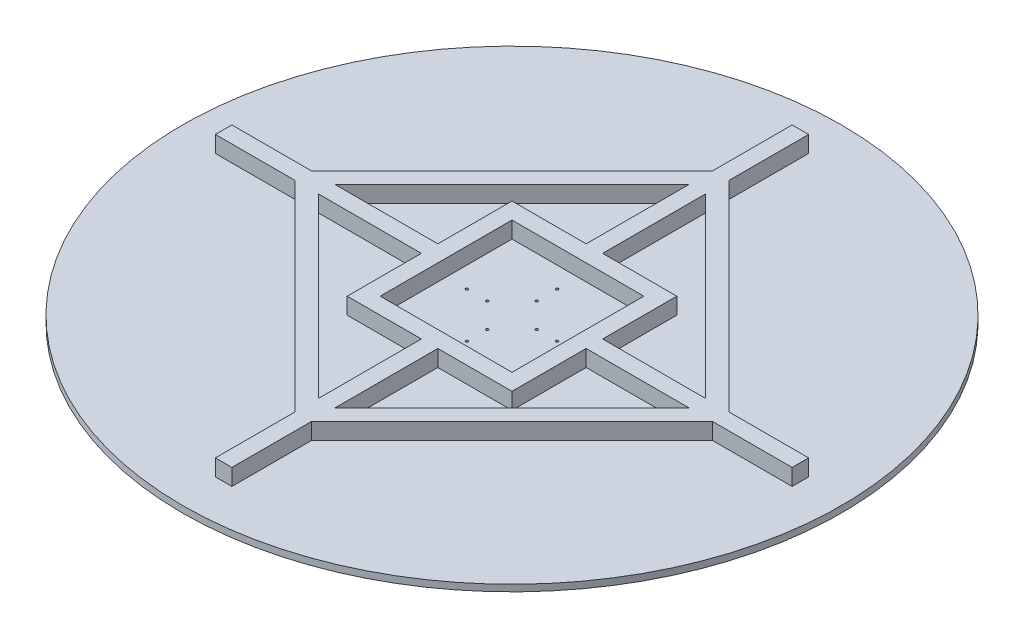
ISO-10303-21;
HEADER;
FILE_DESCRIPTION(('STEP AP214'),'2;1');
FILE_NAME('part.step','',(''),(''),'','','');
FILE_SCHEMA(('AUTOMOTIVE_DESIGN { 1 0 10303 214 1 1 1 1 }'));
ENDSEC;
DATA;
#1=APPLICATION_CONTEXT('core data for automotive mechanical design processes');
#2=APPLICATION_PROTOCOL_DEFINITION('international standard','automotive_design',2000,#1);
#3=PRODUCT_CONTEXT('',#1,'mechanical');
#4=PRODUCT('Part','Part','',(#3));
#5=PRODUCT_RELATED_PRODUCT_CATEGORY('part','',(#4));
#6=PRODUCT_DEFINITION_FORMATION('','',#4);
#7=PRODUCT_DEFINITION_CONTEXT('part definition',#1,'design');
#8=PRODUCT_DEFINITION('design','',#6,#7);
#9=PRODUCT_DEFINITION_SHAPE('','',#8);
#10=(LENGTH_UNIT() NAMED_UNIT(*) SI_UNIT(.MILLI.,.METRE.));
#11=(NAMED_UNIT(*) PLANE_ANGLE_UNIT() SI_UNIT($,.RADIAN.));
#12=(NAMED_UNIT(*) SI_UNIT($,.STERADIAN.) SOLID_ANGLE_UNIT());
#13=UNCERTAINTY_MEASURE_WITH_UNIT(LENGTH_MEASURE(1.E-05),#10,'distance_accuracy_value','');
#14=(GEOMETRIC_REPRESENTATION_CONTEXT(3) GLOBAL_UNCERTAINTY_ASSIGNED_CONTEXT((#13)) GLOBAL_UNIT_ASSIGNED_CONTEXT((#10,
#11,#12)) REPRESENTATION_CONTEXT('',''));
#15=CARTESIAN_POINT('',(0.,0.,0.));
#16=DIRECTION('',(0.,0.,1.));
#17=DIRECTION('',(1.,0.,0.));
#18=AXIS2_PLACEMENT_3D('',#15,#16,#17);
#19=CARTESIAN_POINT('',(0.,8.,0.));
#20=DIRECTION('',(0.,1.,0.));
#21=DIRECTION('',(0.,0.,1.));
#22=AXIS2_PLACEMENT_3D('',#19,#20,#21);
#23=PLANE('',#22);
#24=CARTESIAN_POINT('',(0.,8.,0.));
#25=DIRECTION('',(0.,1.,0.));
#26=DIRECTION('',(0.,0.,1.));
#27=AXIS2_PLACEMENT_3D('',#24,#25,#26);
#28=CIRCLE('',#27,400.);
#29=CARTESIAN_POINT('',(0.,8.,400.));
#30=VERTEX_POINT('',#29);
#31=EDGE_CURVE('E11',#30,#30,#28,.T.);
#32=ORIENTED_EDGE('',*,*,#31,.T.);
#33=EDGE_LOOP('',(#32));
#34=FACE_BOUND('',#33,.T.);
#35=DIRECTION('',(-0.707106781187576,0.,0.70710678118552));
#36=VECTOR('',#35,1.);
#37=CARTESIAN_POINT('',(-10.,8.,-253.28427124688));
#38=LINE('',#37,#36);
#39=CARTESIAN_POINT('',(-10.,8.,-253.28427124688));
#40=VERTEX_POINT('',#39);
#41=CARTESIAN_POINT('',(-253.284271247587,8.,-10.0000000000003));
#42=VERTEX_POINT('',#41);
#43=EDGE_CURVE('E514',#40,#42,#38,.T.);
#44=ORIENTED_EDGE('',*,*,#43,.F.);
#45=DIRECTION('',(0.,0.,1.));
#46=VECTOR('',#45,1.);
#47=CARTESIAN_POINT('',(-10.,8.,-253.28427124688));
#48=LINE('',#47,#46);
#49=CARTESIAN_POINT('',(-10.,8.,-350.));
#50=VERTEX_POINT('',#49);
#51=EDGE_CURVE('E476',#50,#40,#48,.T.);
#52=ORIENTED_EDGE('',*,*,#51,.F.);
#53=DIRECTION('',(-1.,0.,0.));
#54=VECTOR('',#53,1.);
#55=CARTESIAN_POINT('',(-10.,8.,-350.));
#56=LINE('',#55,#54);
#57=CARTESIAN_POINT('',(10.,8.,-350.));
#58=VERTEX_POINT('',#57);
#59=EDGE_CURVE('E481',#58,#50,#56,.T.);
#60=ORIENTED_EDGE('',*,*,#59,.F.);
#61=DIRECTION('',(0.,0.,-1.));
#62=VECTOR('',#61,1.);
#63=CARTESIAN_POINT('',(10.,8.,-350.));
#64=LINE('',#63,#62);
#65=CARTESIAN_POINT('',(10.0000000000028,8.,-253.28427124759));
#66=VERTEX_POINT('',#65);
#67=EDGE_CURVE('E540',#66,#58,#64,.T.);
#68=ORIENTED_EDGE('',*,*,#67,.F.);
#69=DIRECTION('',(-0.70710678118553,0.,-0.707106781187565));
#70=VECTOR('',#69,1.);
#71=CARTESIAN_POINT('',(253.284271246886,8.,-10.0000000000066));
#72=LINE('',#71,#70);
#73=CARTESIAN_POINT('',(253.284271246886,8.,-10.0000000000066));
#74=VERTEX_POINT('',#73);
#75=EDGE_CURVE('E538',#74,#66,#72,.T.);
#76=ORIENTED_EDGE('',*,*,#75,.F.);
#77=DIRECTION('',(-1.,0.,0.));
#78=VECTOR('',#77,1.);
#79=CARTESIAN_POINT('',(253.284271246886,8.,-10.0000000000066));
#80=LINE('',#79,#78);
#81=CARTESIAN_POINT('',(350.,8.,-9.99999999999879));
#82=VERTEX_POINT('',#81);
#83=EDGE_CURVE('E536',#82,#74,#80,.T.);
#84=ORIENTED_EDGE('',*,*,#83,.F.);
#85=DIRECTION('',(0.,0.,-1.));
#86=VECTOR('',#85,1.);
#87=CARTESIAN_POINT('',(350.,8.,-9.99999999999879));
#88=LINE('',#87,#86);
#89=CARTESIAN_POINT('',(350.,8.,10.0000000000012));
#90=VERTEX_POINT('',#89);
#91=EDGE_CURVE('E534',#90,#82,#88,.T.);
#92=ORIENTED_EDGE('',*,*,#91,.F.);
#93=DIRECTION('',(1.,0.,0.));
#94=VECTOR('',#93,1.);
#95=CARTESIAN_POINT('',(350.,8.,10.0000000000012));
#96=LINE('',#95,#94);
#97=CARTESIAN_POINT('',(253.284271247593,8.,9.99999999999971));
#98=VERTEX_POINT('',#97);
#99=EDGE_CURVE('E532',#98,#90,#96,.T.);
#100=ORIENTED_EDGE('',*,*,#99,.F.);
#101=DIRECTION('',(0.707106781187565,0.,-0.70710678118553));
#102=VECTOR('',#101,1.);
#103=CARTESIAN_POINT('',(10.0000000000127,8.,253.28427124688));
#104=LINE('',#103,#102);
#105=CARTESIAN_POINT('',(10.0000000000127,8.,253.28427124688));
#106=VERTEX_POINT('',#105);
#107=EDGE_CURVE('E530',#106,#98,#104,.T.);
#108=ORIENTED_EDGE('',*,*,#107,.F.);
#109=DIRECTION('',(0.,0.,-1.));
#110=VECTOR('',#109,1.);
#111=CARTESIAN_POINT('',(10.0000000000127,8.,253.28427124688));
#112=LINE('',#111,#110);
#113=CARTESIAN_POINT('',(10.0000000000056,8.,349.999999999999));
#114=VERTEX_POINT('',#113);
#115=EDGE_CURVE('E528',#114,#106,#112,.T.);
#116=ORIENTED_EDGE('',*,*,#115,.F.);
#117=DIRECTION('',(1.,0.,0.));
#118=VECTOR('',#117,1.);
#119=CARTESIAN_POINT('',(10.0000000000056,8.,349.999999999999));
#120=LINE('',#119,#118);
#121=CARTESIAN_POINT('',(-9.99999999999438,8.,349.999999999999));
#122=VERTEX_POINT('',#121);
#123=EDGE_CURVE('E526',#122,#114,#120,.T.);
#124=ORIENTED_EDGE('',*,*,#123,.F.);
#125=DIRECTION('',(0.,0.,1.));
#126=VECTOR('',#125,1.);
#127=CARTESIAN_POINT('',(-9.99999999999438,8.,349.999999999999));
#128=LINE('',#127,#126);
#129=CARTESIAN_POINT('',(-9.99999999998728,8.,253.28427124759));
#130=VERTEX_POINT('',#129);
#131=EDGE_CURVE('E524',#130,#122,#128,.T.);
#132=ORIENTED_EDGE('',*,*,#131,.F.);
#133=DIRECTION('',(0.707106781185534,0.,0.707106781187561));
#134=VECTOR('',#133,1.);
#135=CARTESIAN_POINT('',(-253.284271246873,8.,10.0000000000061));
#136=LINE('',#135,#134);
#137=CARTESIAN_POINT('',(-253.284271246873,8.,10.0000000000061));
#138=VERTEX_POINT('',#137);
#139=EDGE_CURVE('E522',#138,#130,#136,.T.);
#140=ORIENTED_EDGE('',*,*,#139,.F.);
#141=DIRECTION('',(1.,0.,1.01376034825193E-13));
#142=VECTOR('',#141,1.);
#143=CARTESIAN_POINT('',(-253.284271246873,8.,10.0000000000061));
#144=LINE('',#143,#142);
#145=CARTESIAN_POINT('',(-350.,8.,9.99999999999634));
#146=VERTEX_POINT('',#145);
#147=EDGE_CURVE('E520',#146,#138,#144,.T.);
#148=ORIENTED_EDGE('',*,*,#147,.F.);
#149=DIRECTION('',(0.,0.,1.));
#150=VECTOR('',#149,1.);
#151=CARTESIAN_POINT('',(-350.,8.,9.99999999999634));
#152=LINE('',#151,#150);
#153=CARTESIAN_POINT('',(-350.,8.,-10.0000000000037));
#154=VERTEX_POINT('',#153);
#155=EDGE_CURVE('E518',#154,#146,#152,.T.);
#156=ORIENTED_EDGE('',*,*,#155,.F.);
#157=DIRECTION('',(-1.,0.,0.));
#158=VECTOR('',#157,1.);
#159=CARTESIAN_POINT('',(-350.,8.,-10.0000000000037));
#160=LINE('',#159,#158);
#161=EDGE_CURVE('E516',#42,#154,#160,.T.);
#162=ORIENTED_EDGE('',*,*,#161,.F.);
#163=EDGE_LOOP('',(#44,#52,#60,#68,#76,#84,#92,#100,#108,#116,#124,#132,#140,#148,#156,#162));
#164=FACE_BOUND('',#163,.T.);
#165=ADVANCED_FACE('F32',(#34,#164),#23,.T.);
#166=DIRECTION('',(0.,0.,-1.));
#167=VECTOR('',#166,1.);
#168=CARTESIAN_POINT('',(80.,8.,80.));
#169=LINE('',#168,#167);
#170=CARTESIAN_POINT('',(80.,8.,80.));
#171=VERTEX_POINT('',#170);
#172=CARTESIAN_POINT('',(80.,8.,-80.));
#173=VERTEX_POINT('',#172);
#174=EDGE_CURVE('E55',#171,#173,#169,.T.);
#175=ORIENTED_EDGE('',*,*,#174,.T.);
#176=DIRECTION('',(-1.,0.,0.));
#177=VECTOR('',#176,1.);
#178=CARTESIAN_POINT('',(-80.,8.,-80.));
#179=LINE('',#178,#177);
#180=CARTESIAN_POINT('',(-80.,8.,-80.));
#181=VERTEX_POINT('',#180);
#182=EDGE_CURVE('E460',#173,#181,#179,.T.);
#183=ORIENTED_EDGE('',*,*,#182,.T.);
#184=DIRECTION('',(0.,0.,1.));
#185=VECTOR('',#184,1.);
#186=CARTESIAN_POINT('',(-80.,8.,80.));
#187=LINE('',#186,#185);
#188=CARTESIAN_POINT('',(-80.,8.,80.));
#189=VERTEX_POINT('',#188);
#190=EDGE_CURVE('E462',#181,#189,#187,.T.);
#191=ORIENTED_EDGE('',*,*,#190,.T.);
#192=DIRECTION('',(1.,0.,0.));
#193=VECTOR('',#192,1.);
#194=CARTESIAN_POINT('',(-80.,8.,80.));
#195=LINE('',#194,#193);
#196=EDGE_CURVE('E451',#189,#171,#195,.T.);
#197=ORIENTED_EDGE('',*,*,#196,.T.);
#198=EDGE_LOOP('',(#175,#183,#191,#197));
#199=FACE_BOUND('',#198,.T.);
#200=CARTESIAN_POINT('',(30.,8.,0.));
#201=DIRECTION('',(0.,1.,0.));
#202=DIRECTION('',(0.,0.,1.));
#203=AXIS2_PLACEMENT_3D('',#200,#201,#202);
#204=CIRCLE('',#203,1.55);
#205=CARTESIAN_POINT('',(30.,8.,1.55));
#206=VERTEX_POINT('',#205);
#207=EDGE_CURVE('E592',#206,#206,#204,.T.);
#208=ORIENTED_EDGE('',*,*,#207,.F.);
#209=EDGE_LOOP('',(#208));
#210=FACE_BOUND('',#209,.T.);
#211=CARTESIAN_POINT('',(-1.04744440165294E-13,8.,30.));
#212=DIRECTION('',(0.,1.,0.));
#213=DIRECTION('',(0.,0.,1.));
#214=AXIS2_PLACEMENT_3D('',#211,#212,#213);
#215=CIRCLE('',#214,1.55);
#216=CARTESIAN_POINT('',(-1.04744440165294E-13,8.,31.55));
#217=VERTEX_POINT('',#216);
#218=EDGE_CURVE('E598',#217,#217,#215,.T.);
#219=ORIENTED_EDGE('',*,*,#218,.F.);
#220=EDGE_LOOP('',(#219));
#221=FACE_BOUND('',#220,.T.);
#222=CARTESIAN_POINT('',(-30.,8.,-2.09488880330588E-13));
#223=DIRECTION('',(0.,1.,0.));
#224=DIRECTION('',(0.,0.,1.));
#225=AXIS2_PLACEMENT_3D('',#222,#223,#224);
#226=CIRCLE('',#225,1.55);
#227=CARTESIAN_POINT('',(-30.,8.,1.54999999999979));
#228=VERTEX_POINT('',#227);
#229=EDGE_CURVE('E604',#228,#228,#226,.T.);
#230=ORIENTED_EDGE('',*,*,#229,.F.);
#231=EDGE_LOOP('',(#230));
#232=FACE_BOUND('',#231,.T.);
#233=CARTESIAN_POINT('',(3.14233320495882E-13,8.,-30.));
#234=DIRECTION('',(0.,1.,0.));
#235=DIRECTION('',(0.,0.,1.));
#236=AXIS2_PLACEMENT_3D('',#233,#234,#235);
#237=CIRCLE('',#236,1.55);
#238=CARTESIAN_POINT('',(3.14233320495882E-13,8.,-28.45));
#239=VERTEX_POINT('',#238);
#240=EDGE_CURVE('E587',#239,#239,#237,.T.);
#241=ORIENTED_EDGE('',*,*,#240,.F.);
#242=EDGE_LOOP('',(#241));
#243=FACE_BOUND('',#242,.T.);
#244=CARTESIAN_POINT('',(-54.8,8.,0.));
#245=DIRECTION('',(0.,1.,0.));
#246=DIRECTION('',(0.,0.,1.));
#247=AXIS2_PLACEMENT_3D('',#244,#245,#246);
#248=CIRCLE('',#247,1.54999999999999);
#249=CARTESIAN_POINT('',(-54.8,8.,1.55));
#250=VERTEX_POINT('',#249);
#251=EDGE_CURVE('E618',#250,#250,#248,.T.);
#252=ORIENTED_EDGE('',*,*,#251,.F.);
#253=EDGE_LOOP('',(#252));
#254=FACE_BOUND('',#253,.T.);
#255=CARTESIAN_POINT('',(54.8,8.,0.));
#256=DIRECTION('',(0.,1.,0.));
#257=DIRECTION('',(0.,0.,1.));
#258=AXIS2_PLACEMENT_3D('',#255,#256,#257);
#259=CIRCLE('',#258,1.54999999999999);
#260=CARTESIAN_POINT('',(54.8,8.,1.54999999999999));
#261=VERTEX_POINT('',#260);
#262=EDGE_CURVE('E630',#261,#261,#259,.T.);
#263=ORIENTED_EDGE('',*,*,#262,.F.);
#264=EDGE_LOOP('',(#263));
#265=FACE_BOUND('',#264,.T.);
#266=CARTESIAN_POINT('',(0.,8.,54.8));
#267=DIRECTION('',(0.,1.,0.));
#268=DIRECTION('',(0.,0.,1.));
#269=AXIS2_PLACEMENT_3D('',#266,#267,#268);
#270=CIRCLE('',#269,1.55);
#271=CARTESIAN_POINT('',(0.,8.,56.35));
#272=VERTEX_POINT('',#271);
#273=EDGE_CURVE('E624',#272,#272,#270,.T.);
#274=ORIENTED_EDGE('',*,*,#273,.F.);
#275=EDGE_LOOP('',(#274));
#276=FACE_BOUND('',#275,.T.);
#277=CARTESIAN_POINT('',(0.,8.,-54.8));
#278=DIRECTION('',(0.,1.,0.));
#279=DIRECTION('',(0.,0.,1.));
#280=AXIS2_PLACEMENT_3D('',#277,#278,#279);
#281=CIRCLE('',#280,1.55);
#282=CARTESIAN_POINT('',(0.,8.,-53.25));
#283=VERTEX_POINT('',#282);
#284=EDGE_CURVE('E612',#283,#283,#281,.T.);
#285=ORIENTED_EDGE('',*,*,#284,.F.);
#286=EDGE_LOOP('',(#285));
#287=FACE_BOUND('',#286,.T.);
#288=ADVANCED_FACE('F654',(#199,#210,#221,#232,#243,#254,#265,#276,#287),#23,.T.);
#289=CARTESIAN_POINT('',(0.,0.,0.));
#290=DIRECTION('',(0.,1.,0.));
#291=DIRECTION('',(0.,0.,1.));
#292=AXIS2_PLACEMENT_3D('',#289,#290,#291);
#293=PLANE('',#292);
#294=CARTESIAN_POINT('',(30.,0.,0.));
#295=DIRECTION('',(0.,1.,0.));
#296=DIRECTION('',(0.,0.,1.));
#297=AXIS2_PLACEMENT_3D('',#294,#295,#296);
#298=CIRCLE('',#297,1.55);
#299=CARTESIAN_POINT('',(30.,0.,1.55));
#300=VERTEX_POINT('',#299);
#301=EDGE_CURVE('E588',#300,#300,#298,.T.);
#302=ORIENTED_EDGE('',*,*,#301,.T.);
#303=EDGE_LOOP('',(#302));
#304=FACE_BOUND('',#303,.T.);
#305=CARTESIAN_POINT('',(-1.04744440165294E-13,0.,30.));
#306=DIRECTION('',(0.,1.,0.));
#307=DIRECTION('',(0.,0.,1.));
#308=AXIS2_PLACEMENT_3D('',#305,#306,#307);
#309=CIRCLE('',#308,1.55);
#310=CARTESIAN_POINT('',(-1.04744440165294E-13,0.,31.55));
#311=VERTEX_POINT('',#310);
#312=EDGE_CURVE('E595',#311,#311,#309,.T.);
#313=ORIENTED_EDGE('',*,*,#312,.T.);
#314=EDGE_LOOP('',(#313));
#315=FACE_BOUND('',#314,.T.);
#316=CARTESIAN_POINT('',(-30.,0.,-2.09488880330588E-13));
#317=DIRECTION('',(0.,1.,0.));
#318=DIRECTION('',(0.,0.,1.));
#319=AXIS2_PLACEMENT_3D('',#316,#317,#318);
#320=CIRCLE('',#319,1.55);
#321=CARTESIAN_POINT('',(-30.,0.,1.54999999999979));
#322=VERTEX_POINT('',#321);
#323=EDGE_CURVE('E601',#322,#322,#320,.T.);
#324=ORIENTED_EDGE('',*,*,#323,.T.);
#325=EDGE_LOOP('',(#324));
#326=FACE_BOUND('',#325,.T.);
#327=CARTESIAN_POINT('',(3.14233320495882E-13,0.,-30.));
#328=DIRECTION('',(0.,1.,0.));
#329=DIRECTION('',(0.,0.,1.));
#330=AXIS2_PLACEMENT_3D('',#327,#328,#329);
#331=CIRCLE('',#330,1.55);
#332=CARTESIAN_POINT('',(3.14233320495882E-13,0.,-28.45));
#333=VERTEX_POINT('',#332);
#334=EDGE_CURVE('E607',#333,#333,#331,.T.);
#335=ORIENTED_EDGE('',*,*,#334,.T.);
#336=EDGE_LOOP('',(#335));
#337=FACE_BOUND('',#336,.T.);
#338=CARTESIAN_POINT('',(0.,0.,0.));
#339=DIRECTION('',(0.,1.,0.));
#340=DIRECTION('',(0.,0.,1.));
#341=AXIS2_PLACEMENT_3D('',#338,#339,#340);
#342=CIRCLE('',#341,400.);
#343=CARTESIAN_POINT('',(0.,0.,400.));
#344=VERTEX_POINT('',#343);
#345=EDGE_CURVE('E36',#344,#344,#342,.T.);
#346=ORIENTED_EDGE('',*,*,#345,.F.);
#347=EDGE_LOOP('',(#346));
#348=FACE_BOUND('',#347,.T.);
#349=CARTESIAN_POINT('',(54.8,0.,0.));
#350=DIRECTION('',(0.,1.,0.));
#351=DIRECTION('',(0.,0.,1.));
#352=AXIS2_PLACEMENT_3D('',#349,#350,#351);
#353=CIRCLE('',#352,1.54999999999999);
#354=CARTESIAN_POINT('',(54.8,0.,1.54999999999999));
#355=VERTEX_POINT('',#354);
#356=EDGE_CURVE('E627',#355,#355,#353,.T.);
#357=ORIENTED_EDGE('',*,*,#356,.T.);
#358=EDGE_LOOP('',(#357));
#359=FACE_BOUND('',#358,.T.);
#360=CARTESIAN_POINT('',(0.,0.,54.8));
#361=DIRECTION('',(0.,1.,0.));
#362=DIRECTION('',(0.,0.,1.));
#363=AXIS2_PLACEMENT_3D('',#360,#361,#362);
#364=CIRCLE('',#363,1.55);
#365=CARTESIAN_POINT('',(0.,0.,56.35));
#366=VERTEX_POINT('',#365);
#367=EDGE_CURVE('E621',#366,#366,#364,.T.);
#368=ORIENTED_EDGE('',*,*,#367,.T.);
#369=EDGE_LOOP('',(#368));
#370=FACE_BOUND('',#369,.T.);
#371=CARTESIAN_POINT('',(-54.8,0.,0.));
#372=DIRECTION('',(0.,1.,0.));
#373=DIRECTION('',(0.,0.,1.));
#374=AXIS2_PLACEMENT_3D('',#371,#372,#373);
#375=CIRCLE('',#374,1.54999999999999);
#376=CARTESIAN_POINT('',(-54.8,0.,1.55));
#377=VERTEX_POINT('',#376);
#378=EDGE_CURVE('E615',#377,#377,#375,.T.);
#379=ORIENTED_EDGE('',*,*,#378,.T.);
#380=EDGE_LOOP('',(#379));
#381=FACE_BOUND('',#380,.T.);
#382=CARTESIAN_POINT('',(0.,0.,-54.8));
#383=DIRECTION('',(0.,1.,0.));
#384=DIRECTION('',(0.,0.,1.));
#385=AXIS2_PLACEMENT_3D('',#382,#383,#384);
#386=CIRCLE('',#385,1.55);
#387=CARTESIAN_POINT('',(0.,0.,-53.25));
#388=VERTEX_POINT('',#387);
#389=EDGE_CURVE('E591',#388,#388,#386,.T.);
#390=ORIENTED_EDGE('',*,*,#389,.T.);
#391=EDGE_LOOP('',(#390));
#392=FACE_BOUND('',#391,.T.);
#393=ADVANCED_FACE('F636',(#304,#315,#326,#337,#348,#359,#370,#381,#392),#293,.F.);
#394=CARTESIAN_POINT('',(0.,8.,0.));
#395=DIRECTION('',(0.,-1.,0.));
#396=DIRECTION('',(0.,0.,-1.));
#397=AXIS2_PLACEMENT_3D('',#394,#395,#396);
#398=CYLINDRICAL_SURFACE('',#397,400.);
#399=ORIENTED_EDGE('',*,*,#31,.F.);
#400=EDGE_LOOP('',(#399));
#401=FACE_BOUND('',#400,.T.);
#402=ORIENTED_EDGE('',*,*,#345,.T.);
#403=EDGE_LOOP('',(#402));
#404=FACE_BOUND('',#403,.T.);
#405=ADVANCED_FACE('F34',(#401,#404),#398,.T.);
#406=CARTESIAN_POINT('',(54.8,8.,0.));
#407=DIRECTION('',(0.,-1.,0.));
#408=DIRECTION('',(0.,0.,-1.));
#409=AXIS2_PLACEMENT_3D('',#406,#407,#408);
#410=CYLINDRICAL_SURFACE('',#409,1.54999999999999);
#411=ORIENTED_EDGE('',*,*,#262,.T.);
#412=EDGE_LOOP('',(#411));
#413=FACE_BOUND('',#412,.T.);
#414=ORIENTED_EDGE('',*,*,#356,.F.);
#415=EDGE_LOOP('',(#414));
#416=FACE_BOUND('',#415,.T.);
#417=ADVANCED_FACE('F639',(#413,#416),#410,.F.);
#418=CARTESIAN_POINT('',(0.,8.,54.8));
#419=DIRECTION('',(0.,-1.,0.));
#420=DIRECTION('',(0.,0.,-1.));
#421=AXIS2_PLACEMENT_3D('',#418,#419,#420);
#422=CYLINDRICAL_SURFACE('',#421,1.55);
#423=ORIENTED_EDGE('',*,*,#273,.T.);
#424=EDGE_LOOP('',(#423));
#425=FACE_BOUND('',#424,.T.);
#426=ORIENTED_EDGE('',*,*,#367,.F.);
#427=EDGE_LOOP('',(#426));
#428=FACE_BOUND('',#427,.T.);
#429=ADVANCED_FACE('F641',(#425,#428),#422,.F.);
#430=CARTESIAN_POINT('',(-54.8,8.,0.));
#431=DIRECTION('',(0.,-1.,0.));
#432=DIRECTION('',(0.,0.,-1.));
#433=AXIS2_PLACEMENT_3D('',#430,#431,#432);
#434=CYLINDRICAL_SURFACE('',#433,1.54999999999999);
#435=ORIENTED_EDGE('',*,*,#251,.T.);
#436=EDGE_LOOP('',(#435));
#437=FACE_BOUND('',#436,.T.);
#438=ORIENTED_EDGE('',*,*,#378,.F.);
#439=EDGE_LOOP('',(#438));
#440=FACE_BOUND('',#439,.T.);
#441=ADVANCED_FACE('F648',(#437,#440),#434,.F.);
#442=CARTESIAN_POINT('',(0.,8.,-54.8));
#443=DIRECTION('',(0.,-1.,0.));
#444=DIRECTION('',(0.,0.,-1.));
#445=AXIS2_PLACEMENT_3D('',#442,#443,#444);
#446=CYLINDRICAL_SURFACE('',#445,1.55);
#447=ORIENTED_EDGE('',*,*,#284,.T.);
#448=EDGE_LOOP('',(#447));
#449=FACE_BOUND('',#448,.T.);
#450=ORIENTED_EDGE('',*,*,#389,.F.);
#451=EDGE_LOOP('',(#450));
#452=FACE_BOUND('',#451,.T.);
#453=ADVANCED_FACE('F850',(#449,#452),#446,.F.);
#454=CARTESIAN_POINT('',(3.14233320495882E-13,0.,-30.));
#455=DIRECTION('',(0.,1.,0.));
#456=DIRECTION('',(0.,0.,1.));
#457=AXIS2_PLACEMENT_3D('',#454,#455,#456);
#458=CYLINDRICAL_SURFACE('',#457,1.55);
#459=ORIENTED_EDGE('',*,*,#334,.F.);
#460=EDGE_LOOP('',(#459));
#461=FACE_BOUND('',#460,.T.);
#462=ORIENTED_EDGE('',*,*,#240,.T.);
#463=EDGE_LOOP('',(#462));
#464=FACE_BOUND('',#463,.T.);
#465=ADVANCED_FACE('F846',(#461,#464),#458,.F.);
#466=CARTESIAN_POINT('',(-30.,0.,-2.09488880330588E-13));
#467=DIRECTION('',(0.,1.,0.));
#468=DIRECTION('',(0.,0.,1.));
#469=AXIS2_PLACEMENT_3D('',#466,#467,#468);
#470=CYLINDRICAL_SURFACE('',#469,1.55);
#471=ORIENTED_EDGE('',*,*,#323,.F.);
#472=EDGE_LOOP('',(#471));
#473=FACE_BOUND('',#472,.T.);
#474=ORIENTED_EDGE('',*,*,#229,.T.);
#475=EDGE_LOOP('',(#474));
#476=FACE_BOUND('',#475,.T.);
#477=ADVANCED_FACE('F842',(#473,#476),#470,.F.);
#478=CARTESIAN_POINT('',(-1.04744440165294E-13,0.,30.));
#479=DIRECTION('',(0.,1.,0.));
#480=DIRECTION('',(0.,0.,1.));
#481=AXIS2_PLACEMENT_3D('',#478,#479,#480);
#482=CYLINDRICAL_SURFACE('',#481,1.55);
#483=ORIENTED_EDGE('',*,*,#312,.F.);
#484=EDGE_LOOP('',(#483));
#485=FACE_BOUND('',#484,.T.);
#486=ORIENTED_EDGE('',*,*,#218,.T.);
#487=EDGE_LOOP('',(#486));
#488=FACE_BOUND('',#487,.T.);
#489=ADVANCED_FACE('F838',(#485,#488),#482,.F.);
#490=CARTESIAN_POINT('',(30.,0.,0.));
#491=DIRECTION('',(0.,1.,0.));
#492=DIRECTION('',(0.,0.,1.));
#493=AXIS2_PLACEMENT_3D('',#490,#491,#492);
#494=CYLINDRICAL_SURFACE('',#493,1.55);
#495=ORIENTED_EDGE('',*,*,#301,.F.);
#496=EDGE_LOOP('',(#495));
#497=FACE_BOUND('',#496,.T.);
#498=ORIENTED_EDGE('',*,*,#207,.T.);
#499=EDGE_LOOP('',(#498));
#500=FACE_BOUND('',#499,.T.);
#501=ADVANCED_FACE('F773',(#497,#500),#494,.F.);
#502=CARTESIAN_POINT('',(0.,28.,0.));
#503=DIRECTION('',(0.,-1.,0.));
#504=DIRECTION('',(0.,0.,-1.));
#505=AXIS2_PLACEMENT_3D('',#502,#503,#504);
#506=PLANE('',#505);
#507=DIRECTION('',(0.,0.,-1.));
#508=VECTOR('',#507,1.);
#509=CARTESIAN_POINT('',(-99.9999999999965,28.,-9.99999999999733));
#510=LINE('',#509,#508);
#511=CARTESIAN_POINT('',(-99.9999999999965,28.,-9.99999999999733));
#512=VERTEX_POINT('',#511);
#513=CARTESIAN_POINT('',(-100.,28.,-100.));
#514=VERTEX_POINT('',#513);
#515=EDGE_CURVE('E341',#512,#514,#510,.T.);
#516=ORIENTED_EDGE('',*,*,#515,.F.);
#517=DIRECTION('',(1.,0.,0.));
#518=VECTOR('',#517,1.);
#519=CARTESIAN_POINT('',(-225.000000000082,28.,-10.0000000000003));
#520=LINE('',#519,#518);
#521=CARTESIAN_POINT('',(-225.000000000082,28.,-10.0000000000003));
#522=VERTEX_POINT('',#521);
#523=EDGE_CURVE('E351',#522,#512,#520,.T.);
#524=ORIENTED_EDGE('',*,*,#523,.F.);
#525=DIRECTION('',(-0.707106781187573,0.,0.707106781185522));
#526=VECTOR('',#525,1.);
#527=CARTESIAN_POINT('',(-10.,28.,-224.999999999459));
#528=LINE('',#527,#526);
#529=CARTESIAN_POINT('',(-10.,28.,-224.999999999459));
#530=VERTEX_POINT('',#529);
#531=EDGE_CURVE('E348',#530,#522,#528,.T.);
#532=ORIENTED_EDGE('',*,*,#531,.F.);
#533=DIRECTION('',(0.,0.,-1.));
#534=VECTOR('',#533,1.);
#535=CARTESIAN_POINT('',(-10.,28.,-100.));
#536=LINE('',#535,#534);
#537=CARTESIAN_POINT('',(-10.,28.,-100.));
#538=VERTEX_POINT('',#537);
#539=EDGE_CURVE('E346',#538,#530,#536,.T.);
#540=ORIENTED_EDGE('',*,*,#539,.F.);
#541=DIRECTION('',(1.,0.,0.));
#542=VECTOR('',#541,1.);
#543=CARTESIAN_POINT('',(-100.,28.,-100.));
#544=LINE('',#543,#542);
#545=EDGE_CURVE('E343',#514,#538,#544,.T.);
#546=ORIENTED_EDGE('',*,*,#545,.F.);
#547=EDGE_LOOP('',(#516,#524,#532,#540,#546));
#548=FACE_BOUND('',#547,.T.);
#549=DIRECTION('',(-1.,0.,0.));
#550=VECTOR('',#549,1.);
#551=CARTESIAN_POINT('',(9.9999999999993,28.,100.));
#552=LINE('',#551,#550);
#553=CARTESIAN_POINT('',(100.,28.,100.));
#554=VERTEX_POINT('',#553);
#555=CARTESIAN_POINT('',(9.9999999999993,28.,100.));
#556=VERTEX_POINT('',#555);
#557=EDGE_CURVE('E413',#554,#556,#552,.T.);
#558=ORIENTED_EDGE('',*,*,#557,.F.);
#559=DIRECTION('',(0.,0.,1.));
#560=VECTOR('',#559,1.);
#561=CARTESIAN_POINT('',(100.,28.,100.));
#562=LINE('',#561,#560);
#563=CARTESIAN_POINT('',(100.,28.,9.9999999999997));
#564=VERTEX_POINT('',#563);
#565=EDGE_CURVE('E423',#564,#554,#562,.T.);
#566=ORIENTED_EDGE('',*,*,#565,.F.);
#567=DIRECTION('',(-1.,0.,0.));
#568=VECTOR('',#567,1.);
#569=CARTESIAN_POINT('',(225.000000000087,28.,9.99999999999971));
#570=LINE('',#569,#568);
#571=CARTESIAN_POINT('',(225.000000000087,28.,9.99999999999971));
#572=VERTEX_POINT('',#571);
#573=EDGE_CURVE('E420',#572,#564,#570,.T.);
#574=ORIENTED_EDGE('',*,*,#573,.F.);
#575=DIRECTION('',(0.707106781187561,0.,-0.707106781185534));
#576=VECTOR('',#575,1.);
#577=CARTESIAN_POINT('',(10.0000000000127,28.,224.999999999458));
#578=LINE('',#577,#576);
#579=CARTESIAN_POINT('',(10.0000000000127,28.,224.999999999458));
#580=VERTEX_POINT('',#579);
#581=EDGE_CURVE('E418',#580,#572,#578,.T.);
#582=ORIENTED_EDGE('',*,*,#581,.F.);
#583=DIRECTION('',(1.07316933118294E-13,0.,1.));
#584=VECTOR('',#583,1.);
#585=CARTESIAN_POINT('',(9.9999999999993,28.,100.));
#586=LINE('',#585,#584);
#587=EDGE_CURVE('E415',#556,#580,#586,.T.);
#588=ORIENTED_EDGE('',*,*,#587,.F.);
#589=EDGE_LOOP('',(#558,#566,#574,#582,#588));
#590=FACE_BOUND('',#589,.T.);
#591=DIRECTION('',(0.,0.,1.));
#592=VECTOR('',#591,1.);
#593=CARTESIAN_POINT('',(-10.,28.,-253.28427124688));
#594=LINE('',#593,#592);
#595=CARTESIAN_POINT('',(-10.,28.,-350.));
#596=VERTEX_POINT('',#595);
#597=CARTESIAN_POINT('',(-10.,28.,-253.28427124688));
#598=VERTEX_POINT('',#597);
#599=EDGE_CURVE('E477',#596,#598,#594,.T.);
#600=ORIENTED_EDGE('',*,*,#599,.T.);
#601=DIRECTION('',(-0.707106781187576,0.,0.70710678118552));
#602=VECTOR('',#601,1.);
#603=CARTESIAN_POINT('',(-10.,28.,-253.28427124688));
#604=LINE('',#603,#602);
#605=CARTESIAN_POINT('',(-253.284271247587,28.,-10.0000000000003));
#606=VERTEX_POINT('',#605);
#607=EDGE_CURVE('E480',#598,#606,#604,.T.);
#608=ORIENTED_EDGE('',*,*,#607,.T.);
#609=DIRECTION('',(-1.,0.,0.));
#610=VECTOR('',#609,1.);
#611=CARTESIAN_POINT('',(-350.,28.,-10.0000000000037));
#612=LINE('',#611,#610);
#613=CARTESIAN_POINT('',(-350.,28.,-10.0000000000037));
#614=VERTEX_POINT('',#613);
#615=EDGE_CURVE('E483',#606,#614,#612,.T.);
#616=ORIENTED_EDGE('',*,*,#615,.T.);
#617=DIRECTION('',(0.,0.,1.));
#618=VECTOR('',#617,1.);
#619=CARTESIAN_POINT('',(-350.,28.,9.99999999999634));
#620=LINE('',#619,#618);
#621=CARTESIAN_POINT('',(-350.,28.,9.99999999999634));
#622=VERTEX_POINT('',#621);
#623=EDGE_CURVE('E485',#614,#622,#620,.T.);
#624=ORIENTED_EDGE('',*,*,#623,.T.);
#625=DIRECTION('',(1.,0.,1.01376034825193E-13));
#626=VECTOR('',#625,1.);
#627=CARTESIAN_POINT('',(-253.284271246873,28.,10.0000000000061));
#628=LINE('',#627,#626);
#629=CARTESIAN_POINT('',(-253.284271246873,28.,10.0000000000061));
#630=VERTEX_POINT('',#629);
#631=EDGE_CURVE('E487',#622,#630,#628,.T.);
#632=ORIENTED_EDGE('',*,*,#631,.T.);
#633=DIRECTION('',(0.707106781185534,0.,0.707106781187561));
#634=VECTOR('',#633,1.);
#635=CARTESIAN_POINT('',(-253.284271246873,28.,10.0000000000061));
#636=LINE('',#635,#634);
#637=CARTESIAN_POINT('',(-9.99999999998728,28.,253.28427124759));
#638=VERTEX_POINT('',#637);
#639=EDGE_CURVE('E489',#630,#638,#636,.T.);
#640=ORIENTED_EDGE('',*,*,#639,.T.);
#641=DIRECTION('',(0.,0.,1.));
#642=VECTOR('',#641,1.);
#643=CARTESIAN_POINT('',(-9.99999999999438,28.,349.999999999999));
#644=LINE('',#643,#642);
#645=CARTESIAN_POINT('',(-9.99999999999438,28.,349.999999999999));
#646=VERTEX_POINT('',#645);
#647=EDGE_CURVE('E491',#638,#646,#644,.T.);
#648=ORIENTED_EDGE('',*,*,#647,.T.);
#649=DIRECTION('',(1.,0.,0.));
#650=VECTOR('',#649,1.);
#651=CARTESIAN_POINT('',(10.0000000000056,28.,349.999999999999));
#652=LINE('',#651,#650);
#653=CARTESIAN_POINT('',(10.0000000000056,28.,349.999999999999));
#654=VERTEX_POINT('',#653);
#655=EDGE_CURVE('E493',#646,#654,#652,.T.);
#656=ORIENTED_EDGE('',*,*,#655,.T.);
#657=DIRECTION('',(0.,0.,-1.));
#658=VECTOR('',#657,1.);
#659=CARTESIAN_POINT('',(10.0000000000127,28.,253.28427124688));
#660=LINE('',#659,#658);
#661=CARTESIAN_POINT('',(10.0000000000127,28.,253.28427124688));
#662=VERTEX_POINT('',#661);
#663=EDGE_CURVE('E495',#654,#662,#660,.T.);
#664=ORIENTED_EDGE('',*,*,#663,.T.);
#665=DIRECTION('',(0.707106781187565,0.,-0.70710678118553));
#666=VECTOR('',#665,1.);
#667=CARTESIAN_POINT('',(10.0000000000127,28.,253.28427124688));
#668=LINE('',#667,#666);
#669=CARTESIAN_POINT('',(253.284271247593,28.,9.99999999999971));
#670=VERTEX_POINT('',#669);
#671=EDGE_CURVE('E497',#662,#670,#668,.T.);
#672=ORIENTED_EDGE('',*,*,#671,.T.);
#673=DIRECTION('',(1.,0.,0.));
#674=VECTOR('',#673,1.);
#675=CARTESIAN_POINT('',(350.,28.,10.0000000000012));
#676=LINE('',#675,#674);
#677=CARTESIAN_POINT('',(350.,28.,10.0000000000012));
#678=VERTEX_POINT('',#677);
#679=EDGE_CURVE('E499',#670,#678,#676,.T.);
#680=ORIENTED_EDGE('',*,*,#679,.T.);
#681=DIRECTION('',(0.,0.,-1.));
#682=VECTOR('',#681,1.);
#683=CARTESIAN_POINT('',(350.,28.,-9.99999999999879));
#684=LINE('',#683,#682);
#685=CARTESIAN_POINT('',(350.,28.,-9.99999999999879));
#686=VERTEX_POINT('',#685);
#687=EDGE_CURVE('E501',#678,#686,#684,.T.);
#688=ORIENTED_EDGE('',*,*,#687,.T.);
#689=DIRECTION('',(-1.,0.,0.));
#690=VECTOR('',#689,1.);
#691=CARTESIAN_POINT('',(253.284271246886,28.,-10.0000000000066));
#692=LINE('',#691,#690);
#693=CARTESIAN_POINT('',(253.284271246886,28.,-10.0000000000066));
#694=VERTEX_POINT('',#693);
#695=EDGE_CURVE('E503',#686,#694,#692,.T.);
#696=ORIENTED_EDGE('',*,*,#695,.T.);
#697=DIRECTION('',(-0.70710678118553,0.,-0.707106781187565));
#698=VECTOR('',#697,1.);
#699=CARTESIAN_POINT('',(253.284271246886,28.,-10.0000000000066));
#700=LINE('',#699,#698);
#701=CARTESIAN_POINT('',(10.0000000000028,28.,-253.28427124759));
#702=VERTEX_POINT('',#701);
#703=EDGE_CURVE('E505',#694,#702,#700,.T.);
#704=ORIENTED_EDGE('',*,*,#703,.T.);
#705=DIRECTION('',(0.,0.,-1.));
#706=VECTOR('',#705,1.);
#707=CARTESIAN_POINT('',(10.,28.,-350.));
#708=LINE('',#707,#706);
#709=CARTESIAN_POINT('',(10.,28.,-350.));
#710=VERTEX_POINT('',#709);
#711=EDGE_CURVE('E507',#702,#710,#708,.T.);
#712=ORIENTED_EDGE('',*,*,#711,.T.);
#713=DIRECTION('',(-1.,0.,0.));
#714=VECTOR('',#713,1.);
#715=CARTESIAN_POINT('',(-10.,28.,-350.));
#716=LINE('',#715,#714);
#717=EDGE_CURVE('E509',#710,#596,#716,.T.);
#718=ORIENTED_EDGE('',*,*,#717,.T.);
#719=EDGE_LOOP('',(#600,#608,#616,#624,#632,#640,#648,#656,#664,#672,#680,#688,#696,#704,#712,#718));
#720=FACE_BOUND('',#719,.T.);
#721=DIRECTION('',(0.,0.,-1.));
#722=VECTOR('',#721,1.);
#723=CARTESIAN_POINT('',(80.,28.,80.));
#724=LINE('',#723,#722);
#725=CARTESIAN_POINT('',(80.,28.,80.));
#726=VERTEX_POINT('',#725);
#727=CARTESIAN_POINT('',(80.,28.,-80.));
#728=VERTEX_POINT('',#727);
#729=EDGE_CURVE('E448',#726,#728,#724,.T.);
#730=ORIENTED_EDGE('',*,*,#729,.F.);
#731=DIRECTION('',(1.,0.,0.));
#732=VECTOR('',#731,1.);
#733=CARTESIAN_POINT('',(-80.,28.,80.));
#734=LINE('',#733,#732);
#735=CARTESIAN_POINT('',(-80.,28.,80.));
#736=VERTEX_POINT('',#735);
#737=EDGE_CURVE('E456',#736,#726,#734,.T.);
#738=ORIENTED_EDGE('',*,*,#737,.F.);
#739=DIRECTION('',(0.,0.,1.));
#740=VECTOR('',#739,1.);
#741=CARTESIAN_POINT('',(-80.,28.,80.));
#742=LINE('',#741,#740);
#743=CARTESIAN_POINT('',(-80.,28.,-80.));
#744=VERTEX_POINT('',#743);
#745=EDGE_CURVE('E453',#744,#736,#742,.T.);
#746=ORIENTED_EDGE('',*,*,#745,.F.);
#747=DIRECTION('',(-1.,0.,0.));
#748=VECTOR('',#747,1.);
#749=CARTESIAN_POINT('',(-80.,28.,-80.));
#750=LINE('',#749,#748);
#751=EDGE_CURVE('E450',#728,#744,#750,.T.);
#752=ORIENTED_EDGE('',*,*,#751,.F.);
#753=EDGE_LOOP('',(#730,#738,#746,#752));
#754=FACE_BOUND('',#753,.T.);
#755=DIRECTION('',(0.,0.,1.));
#756=VECTOR('',#755,1.);
#757=CARTESIAN_POINT('',(100.,28.,-9.99999999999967));
#758=LINE('',#757,#756);
#759=CARTESIAN_POINT('',(100.,28.,-100.));
#760=VERTEX_POINT('',#759);
#761=CARTESIAN_POINT('',(100.,28.,-9.99999999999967));
#762=VERTEX_POINT('',#761);
#763=EDGE_CURVE('E377',#760,#762,#758,.T.);
#764=ORIENTED_EDGE('',*,*,#763,.F.);
#765=DIRECTION('',(1.,0.,0.));
#766=VECTOR('',#765,1.);
#767=CARTESIAN_POINT('',(10.,28.,-100.));
#768=LINE('',#767,#766);
#769=CARTESIAN_POINT('',(10.,28.,-100.));
#770=VERTEX_POINT('',#769);
#771=EDGE_CURVE('E387',#770,#760,#768,.T.);
#772=ORIENTED_EDGE('',*,*,#771,.F.);
#773=DIRECTION('',(0.,0.,1.));
#774=VECTOR('',#773,1.);
#775=CARTESIAN_POINT('',(10.0000000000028,28.,-225.000000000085));
#776=LINE('',#775,#774);
#777=CARTESIAN_POINT('',(10.0000000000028,28.,-225.000000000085));
#778=VERTEX_POINT('',#777);
#779=EDGE_CURVE('E384',#778,#770,#776,.T.);
#780=ORIENTED_EDGE('',*,*,#779,.F.);
#781=DIRECTION('',(-0.707106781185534,0.,-0.707106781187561));
#782=VECTOR('',#781,1.);
#783=CARTESIAN_POINT('',(224.999999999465,28.,-10.0000000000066));
#784=LINE('',#783,#782);
#785=CARTESIAN_POINT('',(224.999999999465,28.,-10.0000000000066));
#786=VERTEX_POINT('',#785);
#787=EDGE_CURVE('E382',#786,#778,#784,.T.);
#788=ORIENTED_EDGE('',*,*,#787,.F.);
#789=DIRECTION('',(1.,0.,0.));
#790=VECTOR('',#789,1.);
#791=CARTESIAN_POINT('',(100.,28.,-9.99999999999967));
#792=LINE('',#791,#790);
#793=EDGE_CURVE('E379',#762,#786,#792,.T.);
#794=ORIENTED_EDGE('',*,*,#793,.F.);
#795=EDGE_LOOP('',(#764,#772,#780,#788,#794));
#796=FACE_BOUND('',#795,.T.);
#797=DIRECTION('',(-1.,0.,0.));
#798=VECTOR('',#797,1.);
#799=CARTESIAN_POINT('',(-100.,28.,100.));
#800=LINE('',#799,#798);
#801=CARTESIAN_POINT('',(-10.0000000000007,28.,99.9999999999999));
#802=VERTEX_POINT('',#801);
#803=CARTESIAN_POINT('',(-100.,28.,100.));
#804=VERTEX_POINT('',#803);
#805=EDGE_CURVE('E291',#802,#804,#800,.T.);
#806=ORIENTED_EDGE('',*,*,#805,.F.);
#807=DIRECTION('',(0.,0.,-1.));
#808=VECTOR('',#807,1.);
#809=CARTESIAN_POINT('',(-9.99999999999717,28.,225.000000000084));
#810=LINE('',#809,#808);
#811=CARTESIAN_POINT('',(-9.99999999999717,28.,225.000000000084));
#812=VERTEX_POINT('',#811);
#813=EDGE_CURVE('E323',#812,#802,#810,.T.);
#814=ORIENTED_EDGE('',*,*,#813,.F.);
#815=DIRECTION('',(0.707106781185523,0.,0.707106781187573));
#816=VECTOR('',#815,1.);
#817=CARTESIAN_POINT('',(-224.999999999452,28.,10.0000000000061));
#818=LINE('',#817,#816);
#819=CARTESIAN_POINT('',(-224.999999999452,28.,10.0000000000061));
#820=VERTEX_POINT('',#819);
#821=EDGE_CURVE('E318',#820,#812,#818,.T.);
#822=ORIENTED_EDGE('',*,*,#821,.F.);
#823=DIRECTION('',(-1.,0.,0.));
#824=VECTOR('',#823,1.);
#825=CARTESIAN_POINT('',(-100.,28.,9.99999999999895));
#826=LINE('',#825,#824);
#827=CARTESIAN_POINT('',(-100.,28.,9.99999999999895));
#828=VERTEX_POINT('',#827);
#829=EDGE_CURVE('E316',#828,#820,#826,.T.);
#830=ORIENTED_EDGE('',*,*,#829,.F.);
#831=DIRECTION('',(0.,0.,-1.));
#832=VECTOR('',#831,1.);
#833=CARTESIAN_POINT('',(-100.,28.,100.));
#834=LINE('',#833,#832);
#835=EDGE_CURVE('E301',#804,#828,#834,.T.);
#836=ORIENTED_EDGE('',*,*,#835,.F.);
#837=EDGE_LOOP('',(#806,#814,#822,#830,#836));
#838=FACE_BOUND('',#837,.T.);
#839=ADVANCED_FACE('F314',(#548,#590,#720,#754,#796,#838),#506,.F.);
#840=CARTESIAN_POINT('',(-10.,28.,-253.28427124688));
#841=DIRECTION('',(1.,0.,0.));
#842=DIRECTION('',(0.,0.,-1.));
#843=AXIS2_PLACEMENT_3D('',#840,#841,#842);
#844=PLANE('',#843);
#845=ORIENTED_EDGE('',*,*,#51,.T.);
#846=DIRECTION('',(0.,-1.,0.));
#847=VECTOR('',#846,1.);
#848=CARTESIAN_POINT('',(-10.,28.,-253.28427124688));
#849=LINE('',#848,#847);
#850=EDGE_CURVE('E585',#598,#40,#849,.T.);
#851=ORIENTED_EDGE('',*,*,#850,.F.);
#852=ORIENTED_EDGE('',*,*,#599,.F.);
#853=DIRECTION('',(0.,-1.,0.));
#854=VECTOR('',#853,1.);
#855=CARTESIAN_POINT('',(-10.,28.,-350.));
#856=LINE('',#855,#854);
#857=EDGE_CURVE('E511',#596,#50,#856,.T.);
#858=ORIENTED_EDGE('',*,*,#857,.T.);
#859=EDGE_LOOP('',(#845,#851,#852,#858));
#860=FACE_BOUND('',#859,.T.);
#861=ADVANCED_FACE('F772',(#860),#844,.F.);
#862=CARTESIAN_POINT('',(-10.,28.,-253.28427124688));
#863=DIRECTION('',(0.70710678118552,0.,0.707106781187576));
#864=DIRECTION('',(0.707106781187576,0.,-0.70710678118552));
#865=AXIS2_PLACEMENT_3D('',#862,#863,#864);
#866=PLANE('',#865);
#867=ORIENTED_EDGE('',*,*,#43,.T.);
#868=DIRECTION('',(0.,-1.,0.));
#869=VECTOR('',#868,1.);
#870=CARTESIAN_POINT('',(-253.284271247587,28.,-10.0000000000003));
#871=LINE('',#870,#869);
#872=EDGE_CURVE('E582',#606,#42,#871,.T.);
#873=ORIENTED_EDGE('',*,*,#872,.F.);
#874=ORIENTED_EDGE('',*,*,#607,.F.);
#875=ORIENTED_EDGE('',*,*,#850,.T.);
#876=EDGE_LOOP('',(#867,#873,#874,#875));
#877=FACE_BOUND('',#876,.T.);
#878=ADVANCED_FACE('F828',(#877),#866,.F.);
#879=CARTESIAN_POINT('',(-350.,28.,-10.0000000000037));
#880=DIRECTION('',(0.,0.,1.));
#881=DIRECTION('',(1.,0.,0.));
#882=AXIS2_PLACEMENT_3D('',#879,#880,#881);
#883=PLANE('',#882);
#884=ORIENTED_EDGE('',*,*,#161,.T.);
#885=DIRECTION('',(0.,-1.,0.));
#886=VECTOR('',#885,1.);
#887=CARTESIAN_POINT('',(-350.,28.,-10.0000000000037));
#888=LINE('',#887,#886);
#889=EDGE_CURVE('E579',#614,#154,#888,.T.);
#890=ORIENTED_EDGE('',*,*,#889,.F.);
#891=ORIENTED_EDGE('',*,*,#615,.F.);
#892=ORIENTED_EDGE('',*,*,#872,.T.);
#893=EDGE_LOOP('',(#884,#890,#891,#892));
#894=FACE_BOUND('',#893,.T.);
#895=ADVANCED_FACE('F824',(#894),#883,.F.);
#896=CARTESIAN_POINT('',(-350.,28.,9.99999999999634));
#897=DIRECTION('',(1.,0.,0.));
#898=DIRECTION('',(0.,0.,-1.));
#899=AXIS2_PLACEMENT_3D('',#896,#897,#898);
#900=PLANE('',#899);
#901=ORIENTED_EDGE('',*,*,#155,.T.);
#902=DIRECTION('',(0.,-1.,0.));
#903=VECTOR('',#902,1.);
#904=CARTESIAN_POINT('',(-350.,28.,9.99999999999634));
#905=LINE('',#904,#903);
#906=EDGE_CURVE('E576',#622,#146,#905,.T.);
#907=ORIENTED_EDGE('',*,*,#906,.F.);
#908=ORIENTED_EDGE('',*,*,#623,.F.);
#909=ORIENTED_EDGE('',*,*,#889,.T.);
#910=EDGE_LOOP('',(#901,#907,#908,#909));
#911=FACE_BOUND('',#910,.T.);
#912=ADVANCED_FACE('F820',(#911),#900,.F.);
#913=CARTESIAN_POINT('',(-253.284271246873,28.,10.0000000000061));
#914=DIRECTION('',(1.01376034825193E-13,0.,-1.));
#915=DIRECTION('',(-1.,0.,-1.01376034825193E-13));
#916=AXIS2_PLACEMENT_3D('',#913,#914,#915);
#917=PLANE('',#916);
#918=ORIENTED_EDGE('',*,*,#147,.T.);
#919=DIRECTION('',(0.,-1.,0.));
#920=VECTOR('',#919,1.);
#921=CARTESIAN_POINT('',(-253.284271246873,28.,10.0000000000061));
#922=LINE('',#921,#920);
#923=EDGE_CURVE('E573',#630,#138,#922,.T.);
#924=ORIENTED_EDGE('',*,*,#923,.F.);
#925=ORIENTED_EDGE('',*,*,#631,.F.);
#926=ORIENTED_EDGE('',*,*,#906,.T.);
#927=EDGE_LOOP('',(#918,#924,#925,#926));
#928=FACE_BOUND('',#927,.T.);
#929=ADVANCED_FACE('F816',(#928),#917,.F.);
#930=CARTESIAN_POINT('',(-253.284271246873,28.,10.0000000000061));
#931=DIRECTION('',(0.707106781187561,0.,-0.707106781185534));
#932=DIRECTION('',(-0.707106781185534,0.,-0.707106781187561));
#933=AXIS2_PLACEMENT_3D('',#930,#931,#932);
#934=PLANE('',#933);
#935=ORIENTED_EDGE('',*,*,#139,.T.);
#936=DIRECTION('',(0.,-1.,0.));
#937=VECTOR('',#936,1.);
#938=CARTESIAN_POINT('',(-9.99999999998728,28.,253.28427124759));
#939=LINE('',#938,#937);
#940=EDGE_CURVE('E570',#638,#130,#939,.T.);
#941=ORIENTED_EDGE('',*,*,#940,.F.);
#942=ORIENTED_EDGE('',*,*,#639,.F.);
#943=ORIENTED_EDGE('',*,*,#923,.T.);
#944=EDGE_LOOP('',(#935,#941,#942,#943));
#945=FACE_BOUND('',#944,.T.);
#946=ADVANCED_FACE('F812',(#945),#934,.F.);
#947=CARTESIAN_POINT('',(-9.99999999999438,28.,349.999999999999));
#948=DIRECTION('',(1.,0.,0.));
#949=DIRECTION('',(0.,0.,-1.));
#950=AXIS2_PLACEMENT_3D('',#947,#948,#949);
#951=PLANE('',#950);
#952=ORIENTED_EDGE('',*,*,#131,.T.);
#953=DIRECTION('',(0.,-1.,0.));
#954=VECTOR('',#953,1.);
#955=CARTESIAN_POINT('',(-9.99999999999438,28.,349.999999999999));
#956=LINE('',#955,#954);
#957=EDGE_CURVE('E567',#646,#122,#956,.T.);
#958=ORIENTED_EDGE('',*,*,#957,.F.);
#959=ORIENTED_EDGE('',*,*,#647,.F.);
#960=ORIENTED_EDGE('',*,*,#940,.T.);
#961=EDGE_LOOP('',(#952,#958,#959,#960));
#962=FACE_BOUND('',#961,.T.);
#963=ADVANCED_FACE('F808',(#962),#951,.F.);
#964=CARTESIAN_POINT('',(10.0000000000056,28.,349.999999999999));
#965=DIRECTION('',(0.,0.,-1.));
#966=DIRECTION('',(-1.,0.,0.));
#967=AXIS2_PLACEMENT_3D('',#964,#965,#966);
#968=PLANE('',#967);
#969=ORIENTED_EDGE('',*,*,#123,.T.);
#970=DIRECTION('',(0.,-1.,0.));
#971=VECTOR('',#970,1.);
#972=CARTESIAN_POINT('',(10.0000000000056,28.,349.999999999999));
#973=LINE('',#972,#971);
#974=EDGE_CURVE('E564',#654,#114,#973,.T.);
#975=ORIENTED_EDGE('',*,*,#974,.F.);
#976=ORIENTED_EDGE('',*,*,#655,.F.);
#977=ORIENTED_EDGE('',*,*,#957,.T.);
#978=EDGE_LOOP('',(#969,#975,#976,#977));
#979=FACE_BOUND('',#978,.T.);
#980=ADVANCED_FACE('F804',(#979),#968,.F.);
#981=CARTESIAN_POINT('',(10.0000000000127,28.,253.28427124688));
#982=DIRECTION('',(-1.,0.,0.));
#983=DIRECTION('',(0.,0.,1.));
#984=AXIS2_PLACEMENT_3D('',#981,#982,#983);
#985=PLANE('',#984);
#986=ORIENTED_EDGE('',*,*,#115,.T.);
#987=DIRECTION('',(0.,-1.,0.));
#988=VECTOR('',#987,1.);
#989=CARTESIAN_POINT('',(10.0000000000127,28.,253.28427124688));
#990=LINE('',#989,#988);
#991=EDGE_CURVE('E561',#662,#106,#990,.T.);
#992=ORIENTED_EDGE('',*,*,#991,.F.);
#993=ORIENTED_EDGE('',*,*,#663,.F.);
#994=ORIENTED_EDGE('',*,*,#974,.T.);
#995=EDGE_LOOP('',(#986,#992,#993,#994));
#996=FACE_BOUND('',#995,.T.);
#997=ADVANCED_FACE('F800',(#996),#985,.F.);
#998=CARTESIAN_POINT('',(10.0000000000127,28.,253.28427124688));
#999=DIRECTION('',(-0.70710678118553,0.,-0.707106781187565));
#1000=DIRECTION('',(-0.707106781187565,0.,0.70710678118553));
#1001=AXIS2_PLACEMENT_3D('',#998,#999,#1000);
#1002=PLANE('',#1001);
#1003=ORIENTED_EDGE('',*,*,#107,.T.);
#1004=DIRECTION('',(0.,-1.,0.));
#1005=VECTOR('',#1004,1.);
#1006=CARTESIAN_POINT('',(253.284271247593,28.,9.99999999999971));
#1007=LINE('',#1006,#1005);
#1008=EDGE_CURVE('E558',#670,#98,#1007,.T.);
#1009=ORIENTED_EDGE('',*,*,#1008,.F.);
#1010=ORIENTED_EDGE('',*,*,#671,.F.);
#1011=ORIENTED_EDGE('',*,*,#991,.T.);
#1012=EDGE_LOOP('',(#1003,#1009,#1010,#1011));
#1013=FACE_BOUND('',#1012,.T.);
#1014=ADVANCED_FACE('F796',(#1013),#1002,.F.);
#1015=CARTESIAN_POINT('',(350.,28.,10.0000000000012));
#1016=DIRECTION('',(0.,0.,-1.));
#1017=DIRECTION('',(-1.,0.,0.));
#1018=AXIS2_PLACEMENT_3D('',#1015,#1016,#1017);
#1019=PLANE('',#1018);
#1020=ORIENTED_EDGE('',*,*,#99,.T.);
#1021=DIRECTION('',(0.,-1.,0.));
#1022=VECTOR('',#1021,1.);
#1023=CARTESIAN_POINT('',(350.,28.,10.0000000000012));
#1024=LINE('',#1023,#1022);
#1025=EDGE_CURVE('E555',#678,#90,#1024,.T.);
#1026=ORIENTED_EDGE('',*,*,#1025,.F.);
#1027=ORIENTED_EDGE('',*,*,#679,.F.);
#1028=ORIENTED_EDGE('',*,*,#1008,.T.);
#1029=EDGE_LOOP('',(#1020,#1026,#1027,#1028));
#1030=FACE_BOUND('',#1029,.T.);
#1031=ADVANCED_FACE('F792',(#1030),#1019,.F.);
#1032=CARTESIAN_POINT('',(350.,28.,-9.99999999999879));
#1033=DIRECTION('',(-1.,0.,0.));
#1034=DIRECTION('',(0.,0.,1.));
#1035=AXIS2_PLACEMENT_3D('',#1032,#1033,#1034);
#1036=PLANE('',#1035);
#1037=ORIENTED_EDGE('',*,*,#91,.T.);
#1038=DIRECTION('',(0.,-1.,0.));
#1039=VECTOR('',#1038,1.);
#1040=CARTESIAN_POINT('',(350.,28.,-9.99999999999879));
#1041=LINE('',#1040,#1039);
#1042=EDGE_CURVE('E552',#686,#82,#1041,.T.);
#1043=ORIENTED_EDGE('',*,*,#1042,.F.);
#1044=ORIENTED_EDGE('',*,*,#687,.F.);
#1045=ORIENTED_EDGE('',*,*,#1025,.T.);
#1046=EDGE_LOOP('',(#1037,#1043,#1044,#1045));
#1047=FACE_BOUND('',#1046,.T.);
#1048=ADVANCED_FACE('F788',(#1047),#1036,.F.);
#1049=CARTESIAN_POINT('',(253.284271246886,28.,-10.0000000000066));
#1050=DIRECTION('',(0.,0.,1.));
#1051=DIRECTION('',(1.,0.,0.));
#1052=AXIS2_PLACEMENT_3D('',#1049,#1050,#1051);
#1053=PLANE('',#1052);
#1054=ORIENTED_EDGE('',*,*,#83,.T.);
#1055=DIRECTION('',(0.,-1.,0.));
#1056=VECTOR('',#1055,1.);
#1057=CARTESIAN_POINT('',(253.284271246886,28.,-10.0000000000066));
#1058=LINE('',#1057,#1056);
#1059=EDGE_CURVE('E549',#694,#74,#1058,.T.);
#1060=ORIENTED_EDGE('',*,*,#1059,.F.);
#1061=ORIENTED_EDGE('',*,*,#695,.F.);
#1062=ORIENTED_EDGE('',*,*,#1042,.T.);
#1063=EDGE_LOOP('',(#1054,#1060,#1061,#1062));
#1064=FACE_BOUND('',#1063,.T.);
#1065=ADVANCED_FACE('F784',(#1064),#1053,.F.);
#1066=CARTESIAN_POINT('',(253.284271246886,28.,-10.0000000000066));
#1067=DIRECTION('',(-0.707106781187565,0.,0.70710678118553));
#1068=DIRECTION('',(0.70710678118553,0.,0.707106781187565));
#1069=AXIS2_PLACEMENT_3D('',#1066,#1067,#1068);
#1070=PLANE('',#1069);
#1071=ORIENTED_EDGE('',*,*,#75,.T.);
#1072=DIRECTION('',(0.,-1.,0.));
#1073=VECTOR('',#1072,1.);
#1074=CARTESIAN_POINT('',(10.0000000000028,28.,-253.28427124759));
#1075=LINE('',#1074,#1073);
#1076=EDGE_CURVE('E546',#702,#66,#1075,.T.);
#1077=ORIENTED_EDGE('',*,*,#1076,.F.);
#1078=ORIENTED_EDGE('',*,*,#703,.F.);
#1079=ORIENTED_EDGE('',*,*,#1059,.T.);
#1080=EDGE_LOOP('',(#1071,#1077,#1078,#1079));
#1081=FACE_BOUND('',#1080,.T.);
#1082=ADVANCED_FACE('F780',(#1081),#1070,.F.);
#1083=CARTESIAN_POINT('',(10.,28.,-350.));
#1084=DIRECTION('',(-1.,0.,0.));
#1085=DIRECTION('',(0.,0.,1.));
#1086=AXIS2_PLACEMENT_3D('',#1083,#1084,#1085);
#1087=PLANE('',#1086);
#1088=ORIENTED_EDGE('',*,*,#67,.T.);
#1089=DIRECTION('',(0.,-1.,0.));
#1090=VECTOR('',#1089,1.);
#1091=CARTESIAN_POINT('',(10.,28.,-350.));
#1092=LINE('',#1091,#1090);
#1093=EDGE_CURVE('E47',#710,#58,#1092,.T.);
#1094=ORIENTED_EDGE('',*,*,#1093,.F.);
#1095=ORIENTED_EDGE('',*,*,#711,.F.);
#1096=ORIENTED_EDGE('',*,*,#1076,.T.);
#1097=EDGE_LOOP('',(#1088,#1094,#1095,#1096));
#1098=FACE_BOUND('',#1097,.T.);
#1099=ADVANCED_FACE('F777',(#1098),#1087,.F.);
#1100=CARTESIAN_POINT('',(-10.,28.,-350.));
#1101=DIRECTION('',(0.,0.,1.));
#1102=DIRECTION('',(1.,0.,0.));
#1103=AXIS2_PLACEMENT_3D('',#1100,#1101,#1102);
#1104=PLANE('',#1103);
#1105=ORIENTED_EDGE('',*,*,#59,.T.);
#1106=ORIENTED_EDGE('',*,*,#857,.F.);
#1107=ORIENTED_EDGE('',*,*,#717,.F.);
#1108=ORIENTED_EDGE('',*,*,#1093,.T.);
#1109=EDGE_LOOP('',(#1105,#1106,#1107,#1108));
#1110=FACE_BOUND('',#1109,.T.);
#1111=ADVANCED_FACE('F768',(#1110),#1104,.F.);
#1112=CARTESIAN_POINT('',(80.,28.,80.));
#1113=DIRECTION('',(-1.,0.,0.));
#1114=DIRECTION('',(0.,0.,1.));
#1115=AXIS2_PLACEMENT_3D('',#1112,#1113,#1114);
#1116=PLANE('',#1115);
#1117=ORIENTED_EDGE('',*,*,#174,.F.);
#1118=DIRECTION('',(0.,-1.,0.));
#1119=VECTOR('',#1118,1.);
#1120=CARTESIAN_POINT('',(80.,28.,80.));
#1121=LINE('',#1120,#1119);
#1122=EDGE_CURVE('E458',#726,#171,#1121,.T.);
#1123=ORIENTED_EDGE('',*,*,#1122,.F.);
#1124=ORIENTED_EDGE('',*,*,#729,.T.);
#1125=DIRECTION('',(0.,-1.,0.));
#1126=VECTOR('',#1125,1.);
#1127=CARTESIAN_POINT('',(80.,28.,-80.));
#1128=LINE('',#1127,#1126);
#1129=EDGE_CURVE('E473',#728,#173,#1128,.T.);
#1130=ORIENTED_EDGE('',*,*,#1129,.T.);
#1131=EDGE_LOOP('',(#1117,#1123,#1124,#1130));
#1132=FACE_BOUND('',#1131,.T.);
#1133=ADVANCED_FACE('F764',(#1132),#1116,.T.);
#1134=CARTESIAN_POINT('',(-80.,28.,-80.));
#1135=DIRECTION('',(0.,0.,1.));
#1136=DIRECTION('',(1.,0.,0.));
#1137=AXIS2_PLACEMENT_3D('',#1134,#1135,#1136);
#1138=PLANE('',#1137);
#1139=ORIENTED_EDGE('',*,*,#182,.F.);
#1140=ORIENTED_EDGE('',*,*,#1129,.F.);
#1141=ORIENTED_EDGE('',*,*,#751,.T.);
#1142=DIRECTION('',(0.,-1.,0.));
#1143=VECTOR('',#1142,1.);
#1144=CARTESIAN_POINT('',(-80.,28.,-80.));
#1145=LINE('',#1144,#1143);
#1146=EDGE_CURVE('E470',#744,#181,#1145,.T.);
#1147=ORIENTED_EDGE('',*,*,#1146,.T.);
#1148=EDGE_LOOP('',(#1139,#1140,#1141,#1147));
#1149=FACE_BOUND('',#1148,.T.);
#1150=ADVANCED_FACE('F760',(#1149),#1138,.T.);
#1151=CARTESIAN_POINT('',(-80.,28.,80.));
#1152=DIRECTION('',(1.,0.,0.));
#1153=DIRECTION('',(0.,0.,-1.));
#1154=AXIS2_PLACEMENT_3D('',#1151,#1152,#1153);
#1155=PLANE('',#1154);
#1156=ORIENTED_EDGE('',*,*,#190,.F.);
#1157=ORIENTED_EDGE('',*,*,#1146,.F.);
#1158=ORIENTED_EDGE('',*,*,#745,.T.);
#1159=DIRECTION('',(0.,-1.,0.));
#1160=VECTOR('',#1159,1.);
#1161=CARTESIAN_POINT('',(-80.,28.,80.));
#1162=LINE('',#1161,#1160);
#1163=EDGE_CURVE('E467',#736,#189,#1162,.T.);
#1164=ORIENTED_EDGE('',*,*,#1163,.T.);
#1165=EDGE_LOOP('',(#1156,#1157,#1158,#1164));
#1166=FACE_BOUND('',#1165,.T.);
#1167=ADVANCED_FACE('F756',(#1166),#1155,.T.);
#1168=CARTESIAN_POINT('',(-80.,28.,80.));
#1169=DIRECTION('',(0.,0.,-1.));
#1170=DIRECTION('',(-1.,0.,0.));
#1171=AXIS2_PLACEMENT_3D('',#1168,#1169,#1170);
#1172=PLANE('',#1171);
#1173=ORIENTED_EDGE('',*,*,#196,.F.);
#1174=ORIENTED_EDGE('',*,*,#1163,.F.);
#1175=ORIENTED_EDGE('',*,*,#737,.T.);
#1176=ORIENTED_EDGE('',*,*,#1122,.T.);
#1177=EDGE_LOOP('',(#1173,#1174,#1175,#1176));
#1178=FACE_BOUND('',#1177,.T.);
#1179=ADVANCED_FACE('F752',(#1178),#1172,.T.);
#1180=CARTESIAN_POINT('',(9.9999999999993,28.,100.));
#1181=DIRECTION('',(0.,0.,1.));
#1182=DIRECTION('',(1.,0.,0.));
#1183=AXIS2_PLACEMENT_3D('',#1180,#1181,#1182);
#1184=PLANE('',#1183);
#1185=DIRECTION('',(-1.,0.,0.));
#1186=VECTOR('',#1185,1.);
#1187=CARTESIAN_POINT('',(9.9999999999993,8.,100.));
#1188=LINE('',#1187,#1186);
#1189=CARTESIAN_POINT('',(100.,8.,100.));
#1190=VERTEX_POINT('',#1189);
#1191=CARTESIAN_POINT('',(9.9999999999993,8.,100.));
#1192=VERTEX_POINT('',#1191);
#1193=EDGE_CURVE('E412',#1190,#1192,#1188,.T.);
#1194=ORIENTED_EDGE('',*,*,#1193,.F.);
#1195=DIRECTION('',(0.,-1.,0.));
#1196=VECTOR('',#1195,1.);
#1197=CARTESIAN_POINT('',(100.,28.,100.));
#1198=LINE('',#1197,#1196);
#1199=EDGE_CURVE('E425',#554,#1190,#1198,.T.);
#1200=ORIENTED_EDGE('',*,*,#1199,.F.);
#1201=ORIENTED_EDGE('',*,*,#557,.T.);
#1202=DIRECTION('',(0.,-1.,0.));
#1203=VECTOR('',#1202,1.);
#1204=CARTESIAN_POINT('',(9.9999999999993,28.,100.));
#1205=LINE('',#1204,#1203);
#1206=EDGE_CURVE('E445',#556,#1192,#1205,.T.);
#1207=ORIENTED_EDGE('',*,*,#1206,.T.);
#1208=EDGE_LOOP('',(#1194,#1200,#1201,#1207));
#1209=FACE_BOUND('',#1208,.T.);
#1210=ADVANCED_FACE('F748',(#1209),#1184,.T.);
#1211=CARTESIAN_POINT('',(9.9999999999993,28.,100.));
#1212=DIRECTION('',(1.,0.,-1.07316933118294E-13));
#1213=DIRECTION('',(-1.07316933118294E-13,0.,-1.));
#1214=AXIS2_PLACEMENT_3D('',#1211,#1212,#1213);
#1215=PLANE('',#1214);
#1216=DIRECTION('',(1.07316933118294E-13,0.,1.));
#1217=VECTOR('',#1216,1.);
#1218=CARTESIAN_POINT('',(9.9999999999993,8.,100.));
#1219=LINE('',#1218,#1217);
#1220=CARTESIAN_POINT('',(10.0000000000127,8.,224.999999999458));
#1221=VERTEX_POINT('',#1220);
#1222=EDGE_CURVE('E427',#1192,#1221,#1219,.T.);
#1223=ORIENTED_EDGE('',*,*,#1222,.F.);
#1224=ORIENTED_EDGE('',*,*,#1206,.F.);
#1225=ORIENTED_EDGE('',*,*,#587,.T.);
#1226=DIRECTION('',(0.,-1.,0.));
#1227=VECTOR('',#1226,1.);
#1228=CARTESIAN_POINT('',(10.0000000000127,28.,224.999999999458));
#1229=LINE('',#1228,#1227);
#1230=EDGE_CURVE('E442',#580,#1221,#1229,.T.);
#1231=ORIENTED_EDGE('',*,*,#1230,.T.);
#1232=EDGE_LOOP('',(#1223,#1224,#1225,#1231));
#1233=FACE_BOUND('',#1232,.T.);
#1234=ADVANCED_FACE('F744',(#1233),#1215,.T.);
#1235=CARTESIAN_POINT('',(10.0000000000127,28.,224.999999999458));
#1236=DIRECTION('',(-0.707106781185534,0.,-0.707106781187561));
#1237=DIRECTION('',(-0.707106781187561,0.,0.707106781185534));
#1238=AXIS2_PLACEMENT_3D('',#1235,#1236,#1237);
#1239=PLANE('',#1238);
#1240=DIRECTION('',(0.707106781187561,0.,-0.707106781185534));
#1241=VECTOR('',#1240,1.);
#1242=CARTESIAN_POINT('',(10.0000000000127,8.,224.999999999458));
#1243=LINE('',#1242,#1241);
#1244=CARTESIAN_POINT('',(225.000000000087,8.,9.99999999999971));
#1245=VERTEX_POINT('',#1244);
#1246=EDGE_CURVE('E429',#1221,#1245,#1243,.T.);
#1247=ORIENTED_EDGE('',*,*,#1246,.F.);
#1248=ORIENTED_EDGE('',*,*,#1230,.F.);
#1249=ORIENTED_EDGE('',*,*,#581,.T.);
#1250=DIRECTION('',(0.,-1.,0.));
#1251=VECTOR('',#1250,1.);
#1252=CARTESIAN_POINT('',(225.000000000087,28.,9.99999999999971));
#1253=LINE('',#1252,#1251);
#1254=EDGE_CURVE('E439',#572,#1245,#1253,.T.);
#1255=ORIENTED_EDGE('',*,*,#1254,.T.);
#1256=EDGE_LOOP('',(#1247,#1248,#1249,#1255));
#1257=FACE_BOUND('',#1256,.T.);
#1258=ADVANCED_FACE('F740',(#1257),#1239,.T.);
#1259=CARTESIAN_POINT('',(225.000000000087,28.,9.99999999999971));
#1260=DIRECTION('',(0.,0.,1.));
#1261=DIRECTION('',(1.,0.,0.));
#1262=AXIS2_PLACEMENT_3D('',#1259,#1260,#1261);
#1263=PLANE('',#1262);
#1264=DIRECTION('',(-1.,0.,0.));
#1265=VECTOR('',#1264,1.);
#1266=CARTESIAN_POINT('',(225.000000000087,8.,9.99999999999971));
#1267=LINE('',#1266,#1265);
#1268=CARTESIAN_POINT('',(100.,8.,9.9999999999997));
#1269=VERTEX_POINT('',#1268);
#1270=EDGE_CURVE('E431',#1245,#1269,#1267,.T.);
#1271=ORIENTED_EDGE('',*,*,#1270,.F.);
#1272=ORIENTED_EDGE('',*,*,#1254,.F.);
#1273=ORIENTED_EDGE('',*,*,#573,.T.);
#1274=DIRECTION('',(0.,-1.,0.));
#1275=VECTOR('',#1274,1.);
#1276=CARTESIAN_POINT('',(100.,28.,9.9999999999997));
#1277=LINE('',#1276,#1275);
#1278=EDGE_CURVE('E436',#564,#1269,#1277,.T.);
#1279=ORIENTED_EDGE('',*,*,#1278,.T.);
#1280=EDGE_LOOP('',(#1271,#1272,#1273,#1279));
#1281=FACE_BOUND('',#1280,.T.);
#1282=ADVANCED_FACE('F736',(#1281),#1263,.T.);
#1283=CARTESIAN_POINT('',(100.,28.,100.));
#1284=DIRECTION('',(1.,0.,0.));
#1285=DIRECTION('',(0.,0.,-1.));
#1286=AXIS2_PLACEMENT_3D('',#1283,#1284,#1285);
#1287=PLANE('',#1286);
#1288=DIRECTION('',(0.,0.,1.));
#1289=VECTOR('',#1288,1.);
#1290=CARTESIAN_POINT('',(100.,8.,100.));
#1291=LINE('',#1290,#1289);
#1292=EDGE_CURVE('E416',#1269,#1190,#1291,.T.);
#1293=ORIENTED_EDGE('',*,*,#1292,.F.);
#1294=ORIENTED_EDGE('',*,*,#1278,.F.);
#1295=ORIENTED_EDGE('',*,*,#565,.T.);
#1296=ORIENTED_EDGE('',*,*,#1199,.T.);
#1297=EDGE_LOOP('',(#1293,#1294,#1295,#1296));
#1298=FACE_BOUND('',#1297,.T.);
#1299=ADVANCED_FACE('F732',(#1298),#1287,.T.);
#1300=CARTESIAN_POINT('',(100.,28.,-9.99999999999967));
#1301=DIRECTION('',(1.,0.,0.));
#1302=DIRECTION('',(0.,0.,-1.));
#1303=AXIS2_PLACEMENT_3D('',#1300,#1301,#1302);
#1304=PLANE('',#1303);
#1305=DIRECTION('',(0.,0.,1.));
#1306=VECTOR('',#1305,1.);
#1307=CARTESIAN_POINT('',(100.,8.,-9.99999999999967));
#1308=LINE('',#1307,#1306);
#1309=CARTESIAN_POINT('',(100.,8.,-100.));
#1310=VERTEX_POINT('',#1309);
#1311=CARTESIAN_POINT('',(100.,8.,-9.99999999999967));
#1312=VERTEX_POINT('',#1311);
#1313=EDGE_CURVE('E376',#1310,#1312,#1308,.T.);
#1314=ORIENTED_EDGE('',*,*,#1313,.F.);
#1315=DIRECTION('',(0.,-1.,0.));
#1316=VECTOR('',#1315,1.);
#1317=CARTESIAN_POINT('',(100.,28.,-100.));
#1318=LINE('',#1317,#1316);
#1319=EDGE_CURVE('E389',#760,#1310,#1318,.T.);
#1320=ORIENTED_EDGE('',*,*,#1319,.F.);
#1321=ORIENTED_EDGE('',*,*,#763,.T.);
#1322=DIRECTION('',(0.,-1.,0.));
#1323=VECTOR('',#1322,1.);
#1324=CARTESIAN_POINT('',(100.,28.,-9.99999999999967));
#1325=LINE('',#1324,#1323);
#1326=EDGE_CURVE('E409',#762,#1312,#1325,.T.);
#1327=ORIENTED_EDGE('',*,*,#1326,.T.);
#1328=EDGE_LOOP('',(#1314,#1320,#1321,#1327));
#1329=FACE_BOUND('',#1328,.T.);
#1330=ADVANCED_FACE('F728',(#1329),#1304,.T.);
#1331=CARTESIAN_POINT('',(100.,28.,-9.99999999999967));
#1332=DIRECTION('',(0.,0.,-1.));
#1333=DIRECTION('',(-1.,0.,0.));
#1334=AXIS2_PLACEMENT_3D('',#1331,#1332,#1333);
#1335=PLANE('',#1334);
#1336=DIRECTION('',(1.,0.,0.));
#1337=VECTOR('',#1336,1.);
#1338=CARTESIAN_POINT('',(100.,8.,-9.99999999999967));
#1339=LINE('',#1338,#1337);
#1340=CARTESIAN_POINT('',(224.999999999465,8.,-10.0000000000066));
#1341=VERTEX_POINT('',#1340);
#1342=EDGE_CURVE('E391',#1312,#1341,#1339,.T.);
#1343=ORIENTED_EDGE('',*,*,#1342,.F.);
#1344=ORIENTED_EDGE('',*,*,#1326,.F.);
#1345=ORIENTED_EDGE('',*,*,#793,.T.);
#1346=DIRECTION('',(0.,-1.,0.));
#1347=VECTOR('',#1346,1.);
#1348=CARTESIAN_POINT('',(224.999999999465,28.,-10.0000000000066));
#1349=LINE('',#1348,#1347);
#1350=EDGE_CURVE('E406',#786,#1341,#1349,.T.);
#1351=ORIENTED_EDGE('',*,*,#1350,.T.);
#1352=EDGE_LOOP('',(#1343,#1344,#1345,#1351));
#1353=FACE_BOUND('',#1352,.T.);
#1354=ADVANCED_FACE('F724',(#1353),#1335,.T.);
#1355=CARTESIAN_POINT('',(224.999999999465,28.,-10.0000000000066));
#1356=DIRECTION('',(-0.707106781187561,0.,0.707106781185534));
#1357=DIRECTION('',(0.707106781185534,0.,0.707106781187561));
#1358=AXIS2_PLACEMENT_3D('',#1355,#1356,#1357);
#1359=PLANE('',#1358);
#1360=DIRECTION('',(-0.707106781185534,0.,-0.707106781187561));
#1361=VECTOR('',#1360,1.);
#1362=CARTESIAN_POINT('',(224.999999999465,8.,-10.0000000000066));
#1363=LINE('',#1362,#1361);
#1364=CARTESIAN_POINT('',(10.0000000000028,8.,-225.000000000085));
#1365=VERTEX_POINT('',#1364);
#1366=EDGE_CURVE('E393',#1341,#1365,#1363,.T.);
#1367=ORIENTED_EDGE('',*,*,#1366,.F.);
#1368=ORIENTED_EDGE('',*,*,#1350,.F.);
#1369=ORIENTED_EDGE('',*,*,#787,.T.);
#1370=DIRECTION('',(0.,-1.,0.));
#1371=VECTOR('',#1370,1.);
#1372=CARTESIAN_POINT('',(10.0000000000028,28.,-225.000000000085));
#1373=LINE('',#1372,#1371);
#1374=EDGE_CURVE('E403',#778,#1365,#1373,.T.);
#1375=ORIENTED_EDGE('',*,*,#1374,.T.);
#1376=EDGE_LOOP('',(#1367,#1368,#1369,#1375));
#1377=FACE_BOUND('',#1376,.T.);
#1378=ADVANCED_FACE('F720',(#1377),#1359,.T.);
#1379=CARTESIAN_POINT('',(10.0000000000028,28.,-225.000000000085));
#1380=DIRECTION('',(1.,0.,0.));
#1381=DIRECTION('',(0.,0.,-1.));
#1382=AXIS2_PLACEMENT_3D('',#1379,#1380,#1381);
#1383=PLANE('',#1382);
#1384=DIRECTION('',(0.,0.,1.));
#1385=VECTOR('',#1384,1.);
#1386=CARTESIAN_POINT('',(10.0000000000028,8.,-225.000000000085));
#1387=LINE('',#1386,#1385);
#1388=CARTESIAN_POINT('',(10.,8.,-100.));
#1389=VERTEX_POINT('',#1388);
#1390=EDGE_CURVE('E395',#1365,#1389,#1387,.T.);
#1391=ORIENTED_EDGE('',*,*,#1390,.F.);
#1392=ORIENTED_EDGE('',*,*,#1374,.F.);
#1393=ORIENTED_EDGE('',*,*,#779,.T.);
#1394=DIRECTION('',(0.,-1.,0.));
#1395=VECTOR('',#1394,1.);
#1396=CARTESIAN_POINT('',(10.,28.,-100.));
#1397=LINE('',#1396,#1395);
#1398=EDGE_CURVE('E400',#770,#1389,#1397,.T.);
#1399=ORIENTED_EDGE('',*,*,#1398,.T.);
#1400=EDGE_LOOP('',(#1391,#1392,#1393,#1399));
#1401=FACE_BOUND('',#1400,.T.);
#1402=ADVANCED_FACE('F716',(#1401),#1383,.T.);
#1403=CARTESIAN_POINT('',(10.,28.,-100.));
#1404=DIRECTION('',(0.,0.,-1.));
#1405=DIRECTION('',(-1.,0.,0.));
#1406=AXIS2_PLACEMENT_3D('',#1403,#1404,#1405);
#1407=PLANE('',#1406);
#1408=DIRECTION('',(1.,0.,0.));
#1409=VECTOR('',#1408,1.);
#1410=CARTESIAN_POINT('',(10.,8.,-100.));
#1411=LINE('',#1410,#1409);
#1412=EDGE_CURVE('E380',#1389,#1310,#1411,.T.);
#1413=ORIENTED_EDGE('',*,*,#1412,.F.);
#1414=ORIENTED_EDGE('',*,*,#1398,.F.);
#1415=ORIENTED_EDGE('',*,*,#771,.T.);
#1416=ORIENTED_EDGE('',*,*,#1319,.T.);
#1417=EDGE_LOOP('',(#1413,#1414,#1415,#1416));
#1418=FACE_BOUND('',#1417,.T.);
#1419=ADVANCED_FACE('F712',(#1418),#1407,.T.);
#1420=CARTESIAN_POINT('',(-99.9999999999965,28.,-9.99999999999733));
#1421=DIRECTION('',(-1.,0.,0.));
#1422=DIRECTION('',(0.,0.,1.));
#1423=AXIS2_PLACEMENT_3D('',#1420,#1421,#1422);
#1424=PLANE('',#1423);
#1425=DIRECTION('',(0.,0.,-1.));
#1426=VECTOR('',#1425,1.);
#1427=CARTESIAN_POINT('',(-99.9999999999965,8.,-9.99999999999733));
#1428=LINE('',#1427,#1426);
#1429=CARTESIAN_POINT('',(-99.9999999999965,8.,-9.99999999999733));
#1430=VERTEX_POINT('',#1429);
#1431=CARTESIAN_POINT('',(-100.,8.,-100.));
#1432=VERTEX_POINT('',#1431);
#1433=EDGE_CURVE('E310',#1430,#1432,#1428,.T.);
#1434=ORIENTED_EDGE('',*,*,#1433,.F.);
#1435=DIRECTION('',(0.,-1.,0.));
#1436=VECTOR('',#1435,1.);
#1437=CARTESIAN_POINT('',(-99.9999999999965,28.,-9.99999999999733));
#1438=LINE('',#1437,#1436);
#1439=EDGE_CURVE('E353',#512,#1430,#1438,.T.);
#1440=ORIENTED_EDGE('',*,*,#1439,.F.);
#1441=ORIENTED_EDGE('',*,*,#515,.T.);
#1442=DIRECTION('',(0.,-1.,0.));
#1443=VECTOR('',#1442,1.);
#1444=CARTESIAN_POINT('',(-100.,28.,-100.));
#1445=LINE('',#1444,#1443);
#1446=EDGE_CURVE('E373',#514,#1432,#1445,.T.);
#1447=ORIENTED_EDGE('',*,*,#1446,.T.);
#1448=EDGE_LOOP('',(#1434,#1440,#1441,#1447));
#1449=FACE_BOUND('',#1448,.T.);
#1450=ADVANCED_FACE('F708',(#1449),#1424,.T.);
#1451=CARTESIAN_POINT('',(-100.,28.,-100.));
#1452=DIRECTION('',(0.,0.,-1.));
#1453=DIRECTION('',(-1.,0.,0.));
#1454=AXIS2_PLACEMENT_3D('',#1451,#1452,#1453);
#1455=PLANE('',#1454);
#1456=DIRECTION('',(1.,0.,0.));
#1457=VECTOR('',#1456,1.);
#1458=CARTESIAN_POINT('',(-100.,8.,-100.));
#1459=LINE('',#1458,#1457);
#1460=CARTESIAN_POINT('',(-10.,8.,-100.));
#1461=VERTEX_POINT('',#1460);
#1462=EDGE_CURVE('E355',#1432,#1461,#1459,.T.);
#1463=ORIENTED_EDGE('',*,*,#1462,.F.);
#1464=ORIENTED_EDGE('',*,*,#1446,.F.);
#1465=ORIENTED_EDGE('',*,*,#545,.T.);
#1466=DIRECTION('',(0.,-1.,0.));
#1467=VECTOR('',#1466,1.);
#1468=CARTESIAN_POINT('',(-10.,28.,-100.));
#1469=LINE('',#1468,#1467);
#1470=EDGE_CURVE('E370',#538,#1461,#1469,.T.);
#1471=ORIENTED_EDGE('',*,*,#1470,.T.);
#1472=EDGE_LOOP('',(#1463,#1464,#1465,#1471));
#1473=FACE_BOUND('',#1472,.T.);
#1474=ADVANCED_FACE('F704',(#1473),#1455,.T.);
#1475=CARTESIAN_POINT('',(-10.,28.,-100.));
#1476=DIRECTION('',(-1.,0.,0.));
#1477=DIRECTION('',(0.,0.,1.));
#1478=AXIS2_PLACEMENT_3D('',#1475,#1476,#1477);
#1479=PLANE('',#1478);
#1480=DIRECTION('',(0.,0.,-1.));
#1481=VECTOR('',#1480,1.);
#1482=CARTESIAN_POINT('',(-10.,8.,-100.));
#1483=LINE('',#1482,#1481);
#1484=CARTESIAN_POINT('',(-10.,8.,-224.999999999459));
#1485=VERTEX_POINT('',#1484);
#1486=EDGE_CURVE('E357',#1461,#1485,#1483,.T.);
#1487=ORIENTED_EDGE('',*,*,#1486,.F.);
#1488=ORIENTED_EDGE('',*,*,#1470,.F.);
#1489=ORIENTED_EDGE('',*,*,#539,.T.);
#1490=DIRECTION('',(0.,-1.,0.));
#1491=VECTOR('',#1490,1.);
#1492=CARTESIAN_POINT('',(-10.,28.,-224.999999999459));
#1493=LINE('',#1492,#1491);
#1494=EDGE_CURVE('E367',#530,#1485,#1493,.T.);
#1495=ORIENTED_EDGE('',*,*,#1494,.T.);
#1496=EDGE_LOOP('',(#1487,#1488,#1489,#1495));
#1497=FACE_BOUND('',#1496,.T.);
#1498=ADVANCED_FACE('F700',(#1497),#1479,.T.);
#1499=CARTESIAN_POINT('',(-10.,28.,-224.999999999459));
#1500=DIRECTION('',(0.707106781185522,0.,0.707106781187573));
#1501=DIRECTION('',(0.707106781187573,0.,-0.707106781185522));
#1502=AXIS2_PLACEMENT_3D('',#1499,#1500,#1501);
#1503=PLANE('',#1502);
#1504=DIRECTION('',(-0.707106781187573,0.,0.707106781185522));
#1505=VECTOR('',#1504,1.);
#1506=CARTESIAN_POINT('',(-10.,8.,-224.999999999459));
#1507=LINE('',#1506,#1505);
#1508=CARTESIAN_POINT('',(-225.000000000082,8.,-10.0000000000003));
#1509=VERTEX_POINT('',#1508);
#1510=EDGE_CURVE('E359',#1485,#1509,#1507,.T.);
#1511=ORIENTED_EDGE('',*,*,#1510,.F.);
#1512=ORIENTED_EDGE('',*,*,#1494,.F.);
#1513=ORIENTED_EDGE('',*,*,#531,.T.);
#1514=DIRECTION('',(0.,-1.,0.));
#1515=VECTOR('',#1514,1.);
#1516=CARTESIAN_POINT('',(-225.000000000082,28.,-10.0000000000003));
#1517=LINE('',#1516,#1515);
#1518=EDGE_CURVE('E364',#522,#1509,#1517,.T.);
#1519=ORIENTED_EDGE('',*,*,#1518,.T.);
#1520=EDGE_LOOP('',(#1511,#1512,#1513,#1519));
#1521=FACE_BOUND('',#1520,.T.);
#1522=ADVANCED_FACE('F696',(#1521),#1503,.T.);
#1523=CARTESIAN_POINT('',(-225.000000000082,28.,-10.0000000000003));
#1524=DIRECTION('',(0.,0.,-1.));
#1525=DIRECTION('',(-1.,0.,0.));
#1526=AXIS2_PLACEMENT_3D('',#1523,#1524,#1525);
#1527=PLANE('',#1526);
#1528=DIRECTION('',(1.,0.,0.));
#1529=VECTOR('',#1528,1.);
#1530=CARTESIAN_POINT('',(-225.000000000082,8.,-10.0000000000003));
#1531=LINE('',#1530,#1529);
#1532=EDGE_CURVE('E344',#1509,#1430,#1531,.T.);
#1533=ORIENTED_EDGE('',*,*,#1532,.F.);
#1534=ORIENTED_EDGE('',*,*,#1518,.F.);
#1535=ORIENTED_EDGE('',*,*,#523,.T.);
#1536=ORIENTED_EDGE('',*,*,#1439,.T.);
#1537=EDGE_LOOP('',(#1533,#1534,#1535,#1536));
#1538=FACE_BOUND('',#1537,.T.);
#1539=ADVANCED_FACE('F693',(#1538),#1527,.T.);
#1540=CARTESIAN_POINT('',(-100.,28.,100.));
#1541=DIRECTION('',(0.,0.,1.));
#1542=DIRECTION('',(1.,0.,0.));
#1543=AXIS2_PLACEMENT_3D('',#1540,#1541,#1542);
#1544=PLANE('',#1543);
#1545=DIRECTION('',(-1.,0.,0.));
#1546=VECTOR('',#1545,1.);
#1547=CARTESIAN_POINT('',(-100.,8.,100.));
#1548=LINE('',#1547,#1546);
#1549=CARTESIAN_POINT('',(-10.0000000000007,8.,99.9999999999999));
#1550=VERTEX_POINT('',#1549);
#1551=CARTESIAN_POINT('',(-100.,8.,100.));
#1552=VERTEX_POINT('',#1551);
#1553=EDGE_CURVE('E325',#1550,#1552,#1548,.T.);
#1554=ORIENTED_EDGE('',*,*,#1553,.F.);
#1555=DIRECTION('',(0.,-1.,0.));
#1556=VECTOR('',#1555,1.);
#1557=CARTESIAN_POINT('',(-10.0000000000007,28.,99.9999999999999));
#1558=LINE('',#1557,#1556);
#1559=EDGE_CURVE('E297',#802,#1550,#1558,.T.);
#1560=ORIENTED_EDGE('',*,*,#1559,.F.);
#1561=ORIENTED_EDGE('',*,*,#805,.T.);
#1562=DIRECTION('',(0.,-1.,0.));
#1563=VECTOR('',#1562,1.);
#1564=CARTESIAN_POINT('',(-100.,28.,100.));
#1565=LINE('',#1564,#1563);
#1566=EDGE_CURVE('E295',#804,#1552,#1565,.T.);
#1567=ORIENTED_EDGE('',*,*,#1566,.T.);
#1568=EDGE_LOOP('',(#1554,#1560,#1561,#1567));
#1569=FACE_BOUND('',#1568,.T.);
#1570=ADVANCED_FACE('F294',(#1569),#1544,.T.);
#1571=CARTESIAN_POINT('',(-100.,28.,100.));
#1572=DIRECTION('',(-1.,0.,0.));
#1573=DIRECTION('',(0.,0.,1.));
#1574=AXIS2_PLACEMENT_3D('',#1571,#1572,#1573);
#1575=PLANE('',#1574);
#1576=DIRECTION('',(0.,0.,-1.));
#1577=VECTOR('',#1576,1.);
#1578=CARTESIAN_POINT('',(-100.,8.,100.));
#1579=LINE('',#1578,#1577);
#1580=CARTESIAN_POINT('',(-100.,8.,9.99999999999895));
#1581=VERTEX_POINT('',#1580);
#1582=EDGE_CURVE('E309',#1552,#1581,#1579,.T.);
#1583=ORIENTED_EDGE('',*,*,#1582,.F.);
#1584=ORIENTED_EDGE('',*,*,#1566,.F.);
#1585=ORIENTED_EDGE('',*,*,#835,.T.);
#1586=DIRECTION('',(0.,-1.,0.));
#1587=VECTOR('',#1586,1.);
#1588=CARTESIAN_POINT('',(-100.,28.,9.99999999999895));
#1589=LINE('',#1588,#1587);
#1590=EDGE_CURVE('E311',#828,#1581,#1589,.T.);
#1591=ORIENTED_EDGE('',*,*,#1590,.T.);
#1592=EDGE_LOOP('',(#1583,#1584,#1585,#1591));
#1593=FACE_BOUND('',#1592,.T.);
#1594=ADVANCED_FACE('F306',(#1593),#1575,.T.);
#1595=CARTESIAN_POINT('',(-100.,28.,9.99999999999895));
#1596=DIRECTION('',(0.,0.,1.));
#1597=DIRECTION('',(1.,0.,0.));
#1598=AXIS2_PLACEMENT_3D('',#1595,#1596,#1597);
#1599=PLANE('',#1598);
#1600=DIRECTION('',(-1.,0.,0.));
#1601=VECTOR('',#1600,1.);
#1602=CARTESIAN_POINT('',(-100.,8.,9.99999999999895));
#1603=LINE('',#1602,#1601);
#1604=CARTESIAN_POINT('',(-224.999999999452,8.,10.0000000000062));
#1605=VERTEX_POINT('',#1604);
#1606=EDGE_CURVE('E328',#1581,#1605,#1603,.T.);
#1607=ORIENTED_EDGE('',*,*,#1606,.F.);
#1608=ORIENTED_EDGE('',*,*,#1590,.F.);
#1609=ORIENTED_EDGE('',*,*,#829,.T.);
#1610=DIRECTION('',(0.,-1.,0.));
#1611=VECTOR('',#1610,1.);
#1612=CARTESIAN_POINT('',(-224.999999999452,28.,10.0000000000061));
#1613=LINE('',#1612,#1611);
#1614=EDGE_CURVE('E337',#820,#1605,#1613,.T.);
#1615=ORIENTED_EDGE('',*,*,#1614,.T.);
#1616=EDGE_LOOP('',(#1607,#1608,#1609,#1615));
#1617=FACE_BOUND('',#1616,.T.);
#1618=ADVANCED_FACE('F681',(#1617),#1599,.T.);
#1619=CARTESIAN_POINT('',(-224.999999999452,28.,10.0000000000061));
#1620=DIRECTION('',(0.707106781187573,0.,-0.707106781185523));
#1621=DIRECTION('',(-0.707106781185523,0.,-0.707106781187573));
#1622=AXIS2_PLACEMENT_3D('',#1619,#1620,#1621);
#1623=PLANE('',#1622);
#1624=DIRECTION('',(0.707106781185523,0.,0.707106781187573));
#1625=VECTOR('',#1624,1.);
#1626=CARTESIAN_POINT('',(-224.999999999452,8.,10.0000000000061));
#1627=LINE('',#1626,#1625);
#1628=CARTESIAN_POINT('',(-9.99999999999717,8.,225.000000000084));
#1629=VERTEX_POINT('',#1628);
#1630=EDGE_CURVE('E330',#1605,#1629,#1627,.T.);
#1631=ORIENTED_EDGE('',*,*,#1630,.F.);
#1632=ORIENTED_EDGE('',*,*,#1614,.F.);
#1633=ORIENTED_EDGE('',*,*,#821,.T.);
#1634=DIRECTION('',(0.,-1.,0.));
#1635=VECTOR('',#1634,1.);
#1636=CARTESIAN_POINT('',(-9.99999999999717,28.,225.000000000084));
#1637=LINE('',#1636,#1635);
#1638=EDGE_CURVE('E334',#812,#1629,#1637,.T.);
#1639=ORIENTED_EDGE('',*,*,#1638,.T.);
#1640=EDGE_LOOP('',(#1631,#1632,#1633,#1639));
#1641=FACE_BOUND('',#1640,.T.);
#1642=ADVANCED_FACE('F672',(#1641),#1623,.T.);
#1643=CARTESIAN_POINT('',(-9.99999999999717,28.,225.000000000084));
#1644=DIRECTION('',(-1.,0.,0.));
#1645=DIRECTION('',(0.,0.,1.));
#1646=AXIS2_PLACEMENT_3D('',#1643,#1644,#1645);
#1647=PLANE('',#1646);
#1648=DIRECTION('',(0.,0.,-1.));
#1649=VECTOR('',#1648,1.);
#1650=CARTESIAN_POINT('',(-9.99999999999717,8.,225.000000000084));
#1651=LINE('',#1650,#1649);
#1652=EDGE_CURVE('E302',#1629,#1550,#1651,.T.);
#1653=ORIENTED_EDGE('',*,*,#1652,.F.);
#1654=ORIENTED_EDGE('',*,*,#1638,.F.);
#1655=ORIENTED_EDGE('',*,*,#813,.T.);
#1656=ORIENTED_EDGE('',*,*,#1559,.T.);
#1657=EDGE_LOOP('',(#1653,#1654,#1655,#1656));
#1658=FACE_BOUND('',#1657,.T.);
#1659=ADVANCED_FACE('F664',(#1658),#1647,.T.);
#1660=ORIENTED_EDGE('',*,*,#1553,.T.);
#1661=ORIENTED_EDGE('',*,*,#1582,.T.);
#1662=ORIENTED_EDGE('',*,*,#1606,.T.);
#1663=ORIENTED_EDGE('',*,*,#1630,.T.);
#1664=ORIENTED_EDGE('',*,*,#1652,.T.);
#1665=EDGE_LOOP('',(#1660,#1661,#1662,#1663,#1664));
#1666=FACE_BOUND('',#1665,.T.);
#1667=ADVANCED_FACE('F656',(#1666),#23,.T.);
#1668=ORIENTED_EDGE('',*,*,#1433,.T.);
#1669=ORIENTED_EDGE('',*,*,#1462,.T.);
#1670=ORIENTED_EDGE('',*,*,#1486,.T.);
#1671=ORIENTED_EDGE('',*,*,#1510,.T.);
#1672=ORIENTED_EDGE('',*,*,#1532,.T.);
#1673=EDGE_LOOP('',(#1668,#1669,#1670,#1671,#1672));
#1674=FACE_BOUND('',#1673,.T.);
#1675=ADVANCED_FACE('F663',(#1674),#23,.T.);
#1676=ORIENTED_EDGE('',*,*,#1313,.T.);
#1677=ORIENTED_EDGE('',*,*,#1342,.T.);
#1678=ORIENTED_EDGE('',*,*,#1366,.T.);
#1679=ORIENTED_EDGE('',*,*,#1390,.T.);
#1680=ORIENTED_EDGE('',*,*,#1412,.T.);
#1681=EDGE_LOOP('',(#1676,#1677,#1678,#1679,#1680));
#1682=FACE_BOUND('',#1681,.T.);
#1683=ADVANCED_FACE('F670',(#1682),#23,.T.);
#1684=ORIENTED_EDGE('',*,*,#1193,.T.);
#1685=ORIENTED_EDGE('',*,*,#1222,.T.);
#1686=ORIENTED_EDGE('',*,*,#1246,.T.);
#1687=ORIENTED_EDGE('',*,*,#1270,.T.);
#1688=ORIENTED_EDGE('',*,*,#1292,.T.);
#1689=EDGE_LOOP('',(#1684,#1685,#1686,#1687,#1688));
#1690=FACE_BOUND('',#1689,.T.);
#1691=ADVANCED_FACE('F660',(#1690),#23,.T.);
#1692=CLOSED_SHELL('',(#165,#288,#393,#405,#417,#429,#441,#453,#465,#477,#489,#501,#839,#861,
#878,#895,#912,#929,#946,#963,#980,#997,#1014,#1031,#1048,#1065,#1082,#1099,#1111,#1133,#1150,
#1167,#1179,#1210,#1234,#1258,#1282,#1299,#1330,#1354,#1378,#1402,#1419,#1450,#1474,#1498,#1522,
#1539,#1570,#1594,#1618,#1642,#1659,#1667,#1675,#1683,#1691));
#1693=MANIFOLD_SOLID_BREP('B2',#1692);
#1694=ADVANCED_BREP_SHAPE_REPRESENTATION('',(#18,#1693),#14);
#1695=SHAPE_DEFINITION_REPRESENTATION(#9,#1694);
ENDSEC;
END-ISO-10303-21;
